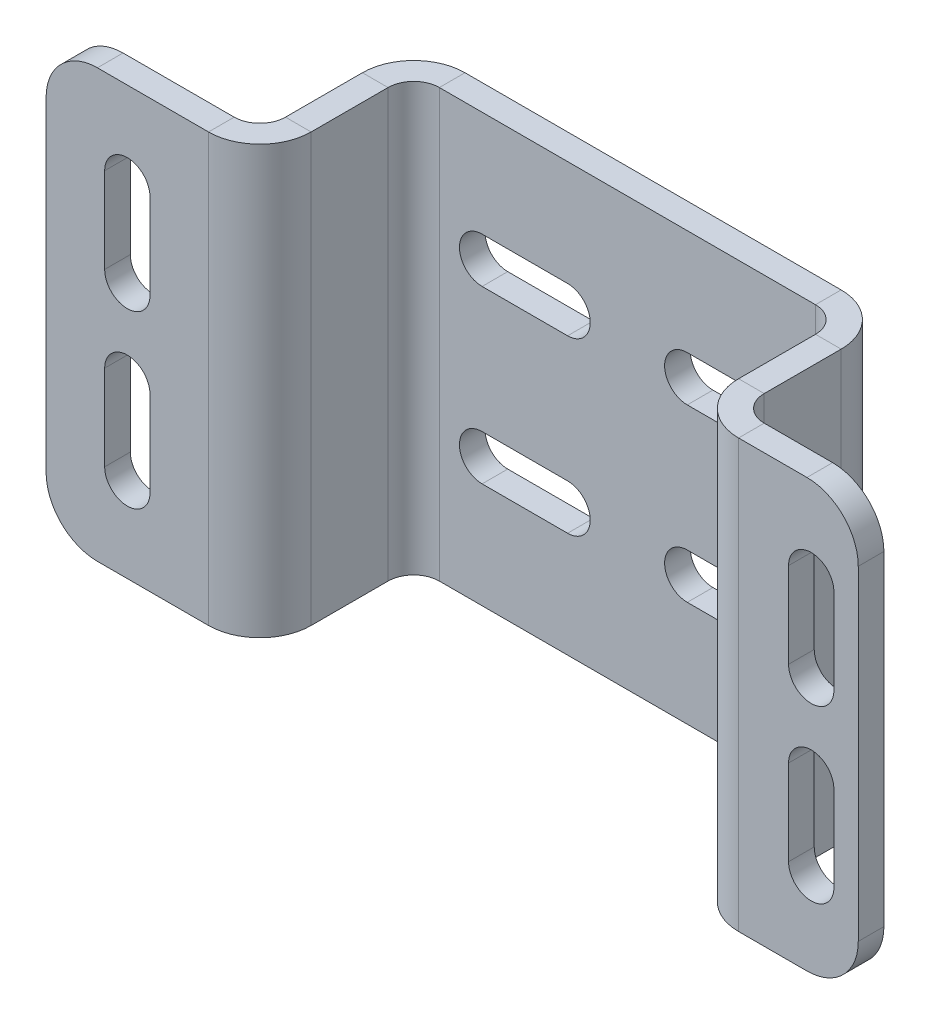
ISO-10303-21;
HEADER;
FILE_DESCRIPTION(('STEP AP214'),'2;1');
FILE_NAME('part.step','',(''),(''),'','','');
FILE_SCHEMA(('AUTOMOTIVE_DESIGN { 1 0 10303 214 1 1 1 1 }'));
ENDSEC;
DATA;
#1=APPLICATION_CONTEXT('core data for automotive mechanical design processes');
#2=APPLICATION_PROTOCOL_DEFINITION('international standard','automotive_design',2000,#1);
#3=PRODUCT_CONTEXT('',#1,'mechanical');
#4=PRODUCT('Part','Part','',(#3));
#5=PRODUCT_RELATED_PRODUCT_CATEGORY('part','',(#4));
#6=PRODUCT_DEFINITION_FORMATION('','',#4);
#7=PRODUCT_DEFINITION_CONTEXT('part definition',#1,'design');
#8=PRODUCT_DEFINITION('design','',#6,#7);
#9=PRODUCT_DEFINITION_SHAPE('','',#8);
#10=(LENGTH_UNIT() NAMED_UNIT(*) SI_UNIT(.MILLI.,.METRE.));
#11=(NAMED_UNIT(*) PLANE_ANGLE_UNIT() SI_UNIT($,.RADIAN.));
#12=(NAMED_UNIT(*) SI_UNIT($,.STERADIAN.) SOLID_ANGLE_UNIT());
#13=UNCERTAINTY_MEASURE_WITH_UNIT(LENGTH_MEASURE(1.E-05),#10,'distance_accuracy_value','');
#14=(GEOMETRIC_REPRESENTATION_CONTEXT(3) GLOBAL_UNCERTAINTY_ASSIGNED_CONTEXT((#13)) GLOBAL_UNIT_ASSIGNED_CONTEXT((#10,
#11,#12)) REPRESENTATION_CONTEXT('',''));
#15=CARTESIAN_POINT('',(0.,0.,0.));
#16=DIRECTION('',(0.,0.,1.));
#17=DIRECTION('',(1.,0.,0.));
#18=AXIS2_PLACEMENT_3D('',#15,#16,#17);
#19=CARTESIAN_POINT('',(0.,50.,2.99999999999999));
#20=DIRECTION('',(0.,-1.,0.));
#21=DIRECTION('',(0.,0.,-1.));
#22=AXIS2_PLACEMENT_3D('',#19,#20,#21);
#23=PLANE('',#22);
#24=DIRECTION('',(1.,0.,0.));
#25=VECTOR('',#24,1.);
#26=CARTESIAN_POINT('',(0.,50.,15.));
#27=LINE('',#26,#25);
#28=CARTESIAN_POINT('',(0.,50.,15.));
#29=VERTEX_POINT('',#28);
#30=CARTESIAN_POINT('',(2.99999999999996,50.,15.));
#31=VERTEX_POINT('',#30);
#32=EDGE_CURVE('E601',#29,#31,#27,.T.);
#33=ORIENTED_EDGE('',*,*,#32,.T.);
#34=DIRECTION('',(0.,0.,1.));
#35=VECTOR('',#34,1.);
#36=CARTESIAN_POINT('',(3.,50.,3.));
#37=LINE('',#36,#35);
#38=CARTESIAN_POINT('',(2.99999999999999,50.,5.99999999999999));
#39=VERTEX_POINT('',#38);
#40=EDGE_CURVE('E800',#31,#39,#37,.F.);
#41=ORIENTED_EDGE('',*,*,#40,.T.);
#42=DIRECTION('',(1.,0.,0.));
#43=VECTOR('',#42,1.);
#44=CARTESIAN_POINT('',(0.,50.,5.99999999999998));
#45=LINE('',#44,#43);
#46=CARTESIAN_POINT('',(0.,50.,5.99999999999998));
#47=VERTEX_POINT('',#46);
#48=EDGE_CURVE('E790',#39,#47,#45,.F.);
#49=ORIENTED_EDGE('',*,*,#48,.T.);
#50=DIRECTION('',(0.,0.,-1.));
#51=VECTOR('',#50,1.);
#52=CARTESIAN_POINT('',(0.,50.,18.));
#53=LINE('',#52,#51);
#54=EDGE_CURVE('E795',#29,#47,#53,.T.);
#55=ORIENTED_EDGE('',*,*,#54,.F.);
#56=EDGE_LOOP('',(#33,#41,#49,#55));
#57=FACE_BOUND('',#56,.T.);
#58=ADVANCED_FACE('F74',(#57),#23,.F.);
#59=CARTESIAN_POINT('',(0.,0.,18.));
#60=DIRECTION('',(0.,1.,0.));
#61=DIRECTION('',(0.,0.,1.));
#62=AXIS2_PLACEMENT_3D('',#59,#60,#61);
#63=PLANE('',#62);
#64=DIRECTION('',(1.,0.,0.));
#65=VECTOR('',#64,1.);
#66=CARTESIAN_POINT('',(0.,0.,15.));
#67=LINE('',#66,#65);
#68=CARTESIAN_POINT('',(0.,0.,15.));
#69=VERTEX_POINT('',#68);
#70=CARTESIAN_POINT('',(2.99999999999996,0.,15.));
#71=VERTEX_POINT('',#70);
#72=EDGE_CURVE('E611',#69,#71,#67,.T.);
#73=ORIENTED_EDGE('',*,*,#72,.F.);
#74=DIRECTION('',(0.,0.,1.));
#75=VECTOR('',#74,1.);
#76=CARTESIAN_POINT('',(0.,0.,18.));
#77=LINE('',#76,#75);
#78=CARTESIAN_POINT('',(0.,0.,5.99999999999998));
#79=VERTEX_POINT('',#78);
#80=EDGE_CURVE('E791',#79,#69,#77,.T.);
#81=ORIENTED_EDGE('',*,*,#80,.F.);
#82=DIRECTION('',(1.,0.,0.));
#83=VECTOR('',#82,1.);
#84=CARTESIAN_POINT('',(2.99999999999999,0.,5.99999999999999));
#85=LINE('',#84,#83);
#86=CARTESIAN_POINT('',(2.99999999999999,0.,5.99999999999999));
#87=VERTEX_POINT('',#86);
#88=EDGE_CURVE('E805',#87,#79,#85,.F.);
#89=ORIENTED_EDGE('',*,*,#88,.F.);
#90=DIRECTION('',(0.,0.,-1.));
#91=VECTOR('',#90,1.);
#92=CARTESIAN_POINT('',(2.99999999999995,0.,18.));
#93=LINE('',#92,#91);
#94=EDGE_CURVE('E797',#87,#71,#93,.F.);
#95=ORIENTED_EDGE('',*,*,#94,.T.);
#96=EDGE_LOOP('',(#73,#81,#89,#95));
#97=FACE_BOUND('',#96,.T.);
#98=ADVANCED_FACE('F954',(#97),#63,.F.);
#99=CARTESIAN_POINT('',(0.,50.,18.));
#100=DIRECTION('',(1.,0.,0.));
#101=DIRECTION('',(0.,0.,-1.));
#102=AXIS2_PLACEMENT_3D('',#99,#100,#101);
#103=PLANE('',#102);
#104=DIRECTION('',(0.,1.,0.));
#105=VECTOR('',#104,1.);
#106=CARTESIAN_POINT('',(0.,50.,15.));
#107=LINE('',#106,#105);
#108=EDGE_CURVE('E607',#29,#69,#107,.F.);
#109=ORIENTED_EDGE('',*,*,#108,.F.);
#110=ORIENTED_EDGE('',*,*,#54,.T.);
#111=DIRECTION('',(0.,-1.,0.));
#112=VECTOR('',#111,1.);
#113=CARTESIAN_POINT('',(0.,50.,5.99999999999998));
#114=LINE('',#113,#112);
#115=EDGE_CURVE('E802',#79,#47,#114,.F.);
#116=ORIENTED_EDGE('',*,*,#115,.F.);
#117=ORIENTED_EDGE('',*,*,#80,.T.);
#118=EDGE_LOOP('',(#109,#110,#116,#117));
#119=FACE_BOUND('',#118,.T.);
#120=ADVANCED_FACE('F959',(#119),#103,.F.);
#121=CARTESIAN_POINT('',(2.99999999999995,50.,18.));
#122=DIRECTION('',(1.,0.,0.));
#123=DIRECTION('',(0.,0.,-1.));
#124=AXIS2_PLACEMENT_3D('',#121,#122,#123);
#125=PLANE('',#124);
#126=ORIENTED_EDGE('',*,*,#40,.F.);
#127=DIRECTION('',(0.,1.,0.));
#128=VECTOR('',#127,1.);
#129=CARTESIAN_POINT('',(2.99999999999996,50.,15.));
#130=LINE('',#129,#128);
#131=EDGE_CURVE('E594',#31,#71,#130,.F.);
#132=ORIENTED_EDGE('',*,*,#131,.T.);
#133=ORIENTED_EDGE('',*,*,#94,.F.);
#134=DIRECTION('',(0.,-1.,0.));
#135=VECTOR('',#134,1.);
#136=CARTESIAN_POINT('',(2.99999999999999,50.,5.99999999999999));
#137=LINE('',#136,#135);
#138=EDGE_CURVE('E808',#39,#87,#137,.T.);
#139=ORIENTED_EDGE('',*,*,#138,.F.);
#140=EDGE_LOOP('',(#126,#132,#133,#139));
#141=FACE_BOUND('',#140,.T.);
#142=ADVANCED_FACE('F972',(#141),#125,.T.);
#143=CARTESIAN_POINT('',(56.0000000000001,50.,18.));
#144=DIRECTION('',(0.,-1.,0.));
#145=DIRECTION('',(0.,0.,-1.));
#146=AXIS2_PLACEMENT_3D('',#143,#144,#145);
#147=PLANE('',#146);
#148=DIRECTION('',(-1.,0.,0.));
#149=VECTOR('',#148,1.);
#150=CARTESIAN_POINT('',(56.,50.,15.));
#151=LINE('',#150,#149);
#152=CARTESIAN_POINT('',(56.,50.,15.));
#153=VERTEX_POINT('',#152);
#154=CARTESIAN_POINT('',(53.,50.,15.));
#155=VERTEX_POINT('',#154);
#156=EDGE_CURVE('E661',#153,#155,#151,.T.);
#157=ORIENTED_EDGE('',*,*,#156,.F.);
#158=DIRECTION('',(0.,0.,1.));
#159=VECTOR('',#158,1.);
#160=CARTESIAN_POINT('',(56.,50.,2.99999999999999));
#161=LINE('',#160,#159);
#162=CARTESIAN_POINT('',(56.,50.,5.99999999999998));
#163=VERTEX_POINT('',#162);
#164=EDGE_CURVE('E838',#163,#153,#161,.T.);
#165=ORIENTED_EDGE('',*,*,#164,.F.);
#166=DIRECTION('',(-1.,0.,0.));
#167=VECTOR('',#166,1.);
#168=CARTESIAN_POINT('',(53.,50.,5.99999999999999));
#169=LINE('',#168,#167);
#170=CARTESIAN_POINT('',(53.,50.,5.99999999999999));
#171=VERTEX_POINT('',#170);
#172=EDGE_CURVE('E849',#171,#163,#169,.F.);
#173=ORIENTED_EDGE('',*,*,#172,.F.);
#174=DIRECTION('',(0.,0.,-1.));
#175=VECTOR('',#174,1.);
#176=CARTESIAN_POINT('',(53.0000000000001,50.,18.));
#177=LINE('',#176,#175);
#178=EDGE_CURVE('E843',#171,#155,#177,.F.);
#179=ORIENTED_EDGE('',*,*,#178,.T.);
#180=EDGE_LOOP('',(#157,#165,#173,#179));
#181=FACE_BOUND('',#180,.T.);
#182=ADVANCED_FACE('F1017',(#181),#147,.F.);
#183=CARTESIAN_POINT('',(56.,0.,2.99999999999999));
#184=DIRECTION('',(0.,1.,0.));
#185=DIRECTION('',(0.,0.,1.));
#186=AXIS2_PLACEMENT_3D('',#183,#184,#185);
#187=PLANE('',#186);
#188=DIRECTION('',(-1.,0.,0.));
#189=VECTOR('',#188,1.);
#190=CARTESIAN_POINT('',(56.,0.,15.));
#191=LINE('',#190,#189);
#192=CARTESIAN_POINT('',(56.,0.,15.));
#193=VERTEX_POINT('',#192);
#194=CARTESIAN_POINT('',(53.,0.,15.));
#195=VERTEX_POINT('',#194);
#196=EDGE_CURVE('E651',#193,#195,#191,.T.);
#197=ORIENTED_EDGE('',*,*,#196,.T.);
#198=DIRECTION('',(0.,0.,1.));
#199=VECTOR('',#198,1.);
#200=CARTESIAN_POINT('',(53.,0.,3.));
#201=LINE('',#200,#199);
#202=CARTESIAN_POINT('',(53.,0.,5.99999999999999));
#203=VERTEX_POINT('',#202);
#204=EDGE_CURVE('E841',#195,#203,#201,.F.);
#205=ORIENTED_EDGE('',*,*,#204,.T.);
#206=DIRECTION('',(-1.,0.,0.));
#207=VECTOR('',#206,1.);
#208=CARTESIAN_POINT('',(56.,0.,5.99999999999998));
#209=LINE('',#208,#207);
#210=CARTESIAN_POINT('',(56.,0.,5.99999999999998));
#211=VERTEX_POINT('',#210);
#212=EDGE_CURVE('E832',#203,#211,#209,.F.);
#213=ORIENTED_EDGE('',*,*,#212,.T.);
#214=DIRECTION('',(0.,0.,-1.));
#215=VECTOR('',#214,1.);
#216=CARTESIAN_POINT('',(56.,0.,2.99999999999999));
#217=LINE('',#216,#215);
#218=EDGE_CURVE('E835',#193,#211,#217,.T.);
#219=ORIENTED_EDGE('',*,*,#218,.F.);
#220=EDGE_LOOP('',(#197,#205,#213,#219));
#221=FACE_BOUND('',#220,.T.);
#222=ADVANCED_FACE('F1009',(#221),#187,.F.);
#223=CARTESIAN_POINT('',(56.,50.,2.99999999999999));
#224=DIRECTION('',(-1.,0.,0.));
#225=DIRECTION('',(0.,0.,1.));
#226=AXIS2_PLACEMENT_3D('',#223,#224,#225);
#227=PLANE('',#226);
#228=DIRECTION('',(0.,-1.,0.));
#229=VECTOR('',#228,1.);
#230=CARTESIAN_POINT('',(56.,0.,15.));
#231=LINE('',#230,#229);
#232=EDGE_CURVE('E657',#193,#153,#231,.F.);
#233=ORIENTED_EDGE('',*,*,#232,.F.);
#234=ORIENTED_EDGE('',*,*,#218,.T.);
#235=DIRECTION('',(0.,1.,0.));
#236=VECTOR('',#235,1.);
#237=CARTESIAN_POINT('',(56.,0.,5.99999999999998));
#238=LINE('',#237,#236);
#239=EDGE_CURVE('E846',#163,#211,#238,.F.);
#240=ORIENTED_EDGE('',*,*,#239,.F.);
#241=ORIENTED_EDGE('',*,*,#164,.T.);
#242=EDGE_LOOP('',(#233,#234,#240,#241));
#243=FACE_BOUND('',#242,.T.);
#244=ADVANCED_FACE('F1020',(#243),#227,.F.);
#245=CARTESIAN_POINT('',(53.,50.,3.));
#246=DIRECTION('',(-1.,0.,0.));
#247=DIRECTION('',(0.,0.,1.));
#248=AXIS2_PLACEMENT_3D('',#245,#246,#247);
#249=PLANE('',#248);
#250=ORIENTED_EDGE('',*,*,#204,.F.);
#251=DIRECTION('',(0.,-1.,0.));
#252=VECTOR('',#251,1.);
#253=CARTESIAN_POINT('',(53.,0.,15.));
#254=LINE('',#253,#252);
#255=EDGE_CURVE('E644',#195,#155,#254,.F.);
#256=ORIENTED_EDGE('',*,*,#255,.T.);
#257=ORIENTED_EDGE('',*,*,#178,.F.);
#258=DIRECTION('',(0.,1.,0.));
#259=VECTOR('',#258,1.);
#260=CARTESIAN_POINT('',(53.,0.,5.99999999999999));
#261=LINE('',#260,#259);
#262=EDGE_CURVE('E852',#203,#171,#261,.T.);
#263=ORIENTED_EDGE('',*,*,#262,.F.);
#264=EDGE_LOOP('',(#250,#256,#257,#263));
#265=FACE_BOUND('',#264,.T.);
#266=ADVANCED_FACE('F1012',(#265),#249,.T.);
#267=CARTESIAN_POINT('',(0.,0.,3.));
#268=DIRECTION('',(0.,1.,0.));
#269=DIRECTION('',(0.,0.,1.));
#270=AXIS2_PLACEMENT_3D('',#267,#268,#269);
#271=PLANE('',#270);
#272=DIRECTION('',(0.,0.,-1.));
#273=VECTOR('',#272,1.);
#274=CARTESIAN_POINT('',(5.99999999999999,0.,3.));
#275=LINE('',#274,#273);
#276=CARTESIAN_POINT('',(5.99999999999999,0.,3.));
#277=VERTEX_POINT('',#276);
#278=CARTESIAN_POINT('',(5.99999999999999,0.,0.));
#279=VERTEX_POINT('',#278);
#280=EDGE_CURVE('E819',#277,#279,#275,.T.);
#281=ORIENTED_EDGE('',*,*,#280,.T.);
#282=DIRECTION('',(1.,0.,0.));
#283=VECTOR('',#282,1.);
#284=CARTESIAN_POINT('',(0.,0.,0.));
#285=LINE('',#284,#283);
#286=CARTESIAN_POINT('',(50.,0.,0.));
#287=VERTEX_POINT('',#286);
#288=EDGE_CURVE('E876',#279,#287,#285,.T.);
#289=ORIENTED_EDGE('',*,*,#288,.T.);
#290=DIRECTION('',(0.,0.,-1.));
#291=VECTOR('',#290,1.);
#292=CARTESIAN_POINT('',(50.,0.,3.));
#293=LINE('',#292,#291);
#294=CARTESIAN_POINT('',(50.,0.,3.));
#295=VERTEX_POINT('',#294);
#296=EDGE_CURVE('E873',#295,#287,#293,.T.);
#297=ORIENTED_EDGE('',*,*,#296,.F.);
#298=DIRECTION('',(1.,0.,0.));
#299=VECTOR('',#298,1.);
#300=CARTESIAN_POINT('',(0.,0.,3.));
#301=LINE('',#300,#299);
#302=EDGE_CURVE('E879',#277,#295,#301,.T.);
#303=ORIENTED_EDGE('',*,*,#302,.F.);
#304=EDGE_LOOP('',(#281,#289,#297,#303));
#305=FACE_BOUND('',#304,.T.);
#306=ADVANCED_FACE('F982',(#305),#271,.F.);
#307=CARTESIAN_POINT('',(0.,50.,3.));
#308=DIRECTION('',(0.,-1.,0.));
#309=DIRECTION('',(0.,0.,-1.));
#310=AXIS2_PLACEMENT_3D('',#307,#308,#309);
#311=PLANE('',#310);
#312=DIRECTION('',(0.,0.,-1.));
#313=VECTOR('',#312,1.);
#314=CARTESIAN_POINT('',(5.99999999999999,50.,3.));
#315=LINE('',#314,#313);
#316=CARTESIAN_POINT('',(5.99999999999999,50.,3.));
#317=VERTEX_POINT('',#316);
#318=CARTESIAN_POINT('',(5.99999999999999,50.,0.));
#319=VERTEX_POINT('',#318);
#320=EDGE_CURVE('E829',#317,#319,#315,.T.);
#321=ORIENTED_EDGE('',*,*,#320,.F.);
#322=DIRECTION('',(-1.,0.,0.));
#323=VECTOR('',#322,1.);
#324=CARTESIAN_POINT('',(0.,50.,3.));
#325=LINE('',#324,#323);
#326=CARTESIAN_POINT('',(50.,50.,3.));
#327=VERTEX_POINT('',#326);
#328=EDGE_CURVE('E882',#327,#317,#325,.T.);
#329=ORIENTED_EDGE('',*,*,#328,.F.);
#330=DIRECTION('',(0.,0.,-1.));
#331=VECTOR('',#330,1.);
#332=CARTESIAN_POINT('',(50.,50.,3.));
#333=LINE('',#332,#331);
#334=CARTESIAN_POINT('',(50.,50.,0.));
#335=VERTEX_POINT('',#334);
#336=EDGE_CURVE('E863',#327,#335,#333,.T.);
#337=ORIENTED_EDGE('',*,*,#336,.T.);
#338=DIRECTION('',(-1.,0.,0.));
#339=VECTOR('',#338,1.);
#340=CARTESIAN_POINT('',(0.,50.,0.));
#341=LINE('',#340,#339);
#342=EDGE_CURVE('E883',#335,#319,#341,.T.);
#343=ORIENTED_EDGE('',*,*,#342,.T.);
#344=EDGE_LOOP('',(#321,#329,#337,#343));
#345=FACE_BOUND('',#344,.T.);
#346=ADVANCED_FACE('F996',(#345),#311,.F.);
#347=CARTESIAN_POINT('',(0.,50.,3.));
#348=DIRECTION('',(0.,0.,-1.));
#349=DIRECTION('',(-1.,0.,0.));
#350=AXIS2_PLACEMENT_3D('',#347,#348,#349);
#351=PLANE('',#350);
#352=DIRECTION('',(1.,0.,0.));
#353=VECTOR('',#352,1.);
#354=CARTESIAN_POINT('',(35.,32.35,3.));
#355=LINE('',#354,#353);
#356=CARTESIAN_POINT('',(35.,32.35,3.));
#357=VERTEX_POINT('',#356);
#358=CARTESIAN_POINT('',(45.,32.35,3.));
#359=VERTEX_POINT('',#358);
#360=EDGE_CURVE('E668',#357,#359,#355,.T.);
#361=ORIENTED_EDGE('',*,*,#360,.F.);
#362=CARTESIAN_POINT('',(35.,35.,3.));
#363=DIRECTION('',(0.,0.,-1.));
#364=DIRECTION('',(-1.,0.,0.));
#365=AXIS2_PLACEMENT_3D('',#362,#363,#364);
#366=CIRCLE('',#365,2.65000000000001);
#367=CARTESIAN_POINT('',(35.,37.65,3.));
#368=VERTEX_POINT('',#367);
#369=EDGE_CURVE('E671',#368,#357,#366,.F.);
#370=ORIENTED_EDGE('',*,*,#369,.F.);
#371=DIRECTION('',(-1.,0.,0.));
#372=VECTOR('',#371,1.);
#373=CARTESIAN_POINT('',(35.,37.65,3.));
#374=LINE('',#373,#372);
#375=CARTESIAN_POINT('',(45.,37.65,3.));
#376=VERTEX_POINT('',#375);
#377=EDGE_CURVE('E688',#376,#368,#374,.T.);
#378=ORIENTED_EDGE('',*,*,#377,.F.);
#379=CARTESIAN_POINT('',(45.,35.,3.));
#380=DIRECTION('',(0.,0.,-1.));
#381=DIRECTION('',(-1.,0.,0.));
#382=AXIS2_PLACEMENT_3D('',#379,#380,#381);
#383=CIRCLE('',#382,2.65);
#384=EDGE_CURVE('E664',#359,#376,#383,.F.);
#385=ORIENTED_EDGE('',*,*,#384,.F.);
#386=EDGE_LOOP('',(#361,#370,#378,#385));
#387=FACE_BOUND('',#386,.T.);
#388=DIRECTION('',(1.,0.,0.));
#389=VECTOR('',#388,1.);
#390=CARTESIAN_POINT('',(35.,12.35,3.));
#391=LINE('',#390,#389);
#392=CARTESIAN_POINT('',(35.,12.35,3.));
#393=VERTEX_POINT('',#392);
#394=CARTESIAN_POINT('',(45.,12.35,3.));
#395=VERTEX_POINT('',#394);
#396=EDGE_CURVE('E699',#393,#395,#391,.T.);
#397=ORIENTED_EDGE('',*,*,#396,.F.);
#398=CARTESIAN_POINT('',(35.,15.,3.));
#399=DIRECTION('',(0.,0.,-1.));
#400=DIRECTION('',(-1.,0.,0.));
#401=AXIS2_PLACEMENT_3D('',#398,#399,#400);
#402=CIRCLE('',#401,2.65);
#403=CARTESIAN_POINT('',(35.,17.65,3.));
#404=VERTEX_POINT('',#403);
#405=EDGE_CURVE('E702',#404,#393,#402,.F.);
#406=ORIENTED_EDGE('',*,*,#405,.F.);
#407=DIRECTION('',(-1.,0.,0.));
#408=VECTOR('',#407,1.);
#409=CARTESIAN_POINT('',(35.,17.65,3.));
#410=LINE('',#409,#408);
#411=CARTESIAN_POINT('',(45.,17.65,3.));
#412=VERTEX_POINT('',#411);
#413=EDGE_CURVE('E719',#412,#404,#410,.T.);
#414=ORIENTED_EDGE('',*,*,#413,.F.);
#415=CARTESIAN_POINT('',(45.,15.,3.));
#416=DIRECTION('',(0.,0.,-1.));
#417=DIRECTION('',(-1.,0.,0.));
#418=AXIS2_PLACEMENT_3D('',#415,#416,#417);
#419=CIRCLE('',#418,2.65);
#420=EDGE_CURVE('E697',#395,#412,#419,.F.);
#421=ORIENTED_EDGE('',*,*,#420,.F.);
#422=EDGE_LOOP('',(#397,#406,#414,#421));
#423=FACE_BOUND('',#422,.T.);
#424=DIRECTION('',(1.,0.,0.));
#425=VECTOR('',#424,1.);
#426=CARTESIAN_POINT('',(11.,32.35,3.));
#427=LINE('',#426,#425);
#428=CARTESIAN_POINT('',(11.,32.35,3.));
#429=VERTEX_POINT('',#428);
#430=CARTESIAN_POINT('',(21.,32.35,3.));
#431=VERTEX_POINT('',#430);
#432=EDGE_CURVE('E730',#429,#431,#427,.T.);
#433=ORIENTED_EDGE('',*,*,#432,.F.);
#434=CARTESIAN_POINT('',(11.,35.,3.));
#435=DIRECTION('',(0.,0.,-1.));
#436=DIRECTION('',(-1.,0.,0.));
#437=AXIS2_PLACEMENT_3D('',#434,#435,#436);
#438=CIRCLE('',#437,2.65);
#439=CARTESIAN_POINT('',(11.,37.65,3.));
#440=VERTEX_POINT('',#439);
#441=EDGE_CURVE('E733',#440,#429,#438,.F.);
#442=ORIENTED_EDGE('',*,*,#441,.F.);
#443=DIRECTION('',(-1.,0.,0.));
#444=VECTOR('',#443,1.);
#445=CARTESIAN_POINT('',(11.,37.65,3.));
#446=LINE('',#445,#444);
#447=CARTESIAN_POINT('',(21.,37.65,3.));
#448=VERTEX_POINT('',#447);
#449=EDGE_CURVE('E750',#448,#440,#446,.T.);
#450=ORIENTED_EDGE('',*,*,#449,.F.);
#451=CARTESIAN_POINT('',(21.,35.,3.));
#452=DIRECTION('',(0.,0.,-1.));
#453=DIRECTION('',(-1.,0.,0.));
#454=AXIS2_PLACEMENT_3D('',#451,#452,#453);
#455=CIRCLE('',#454,2.65);
#456=EDGE_CURVE('E728',#431,#448,#455,.F.);
#457=ORIENTED_EDGE('',*,*,#456,.F.);
#458=EDGE_LOOP('',(#433,#442,#450,#457));
#459=FACE_BOUND('',#458,.T.);
#460=DIRECTION('',(1.,0.,0.));
#461=VECTOR('',#460,1.);
#462=CARTESIAN_POINT('',(11.,12.35,3.));
#463=LINE('',#462,#461);
#464=CARTESIAN_POINT('',(11.,12.35,3.));
#465=VERTEX_POINT('',#464);
#466=CARTESIAN_POINT('',(21.,12.35,3.));
#467=VERTEX_POINT('',#466);
#468=EDGE_CURVE('E761',#465,#467,#463,.T.);
#469=ORIENTED_EDGE('',*,*,#468,.F.);
#470=CARTESIAN_POINT('',(11.,15.,3.));
#471=DIRECTION('',(0.,0.,-1.));
#472=DIRECTION('',(-1.,0.,0.));
#473=AXIS2_PLACEMENT_3D('',#470,#471,#472);
#474=CIRCLE('',#473,2.65);
#475=CARTESIAN_POINT('',(11.,17.65,3.));
#476=VERTEX_POINT('',#475);
#477=EDGE_CURVE('E764',#476,#465,#474,.F.);
#478=ORIENTED_EDGE('',*,*,#477,.F.);
#479=DIRECTION('',(-1.,0.,0.));
#480=VECTOR('',#479,1.);
#481=CARTESIAN_POINT('',(11.,17.65,3.));
#482=LINE('',#481,#480);
#483=CARTESIAN_POINT('',(21.,17.65,3.));
#484=VERTEX_POINT('',#483);
#485=EDGE_CURVE('E781',#484,#476,#482,.T.);
#486=ORIENTED_EDGE('',*,*,#485,.F.);
#487=CARTESIAN_POINT('',(21.,15.,3.));
#488=DIRECTION('',(0.,0.,-1.));
#489=DIRECTION('',(-1.,0.,0.));
#490=AXIS2_PLACEMENT_3D('',#487,#488,#489);
#491=CIRCLE('',#490,2.65);
#492=EDGE_CURVE('E759',#467,#484,#491,.F.);
#493=ORIENTED_EDGE('',*,*,#492,.F.);
#494=EDGE_LOOP('',(#469,#478,#486,#493));
#495=FACE_BOUND('',#494,.T.);
#496=DIRECTION('',(0.,-1.,0.));
#497=VECTOR('',#496,1.);
#498=CARTESIAN_POINT('',(5.99999999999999,0.,3.));
#499=LINE('',#498,#497);
#500=EDGE_CURVE('E825',#277,#317,#499,.F.);
#501=ORIENTED_EDGE('',*,*,#500,.F.);
#502=ORIENTED_EDGE('',*,*,#302,.T.);
#503=DIRECTION('',(0.,1.,0.));
#504=VECTOR('',#503,1.);
#505=CARTESIAN_POINT('',(50.,50.,3.));
#506=LINE('',#505,#504);
#507=EDGE_CURVE('E869',#327,#295,#506,.F.);
#508=ORIENTED_EDGE('',*,*,#507,.F.);
#509=ORIENTED_EDGE('',*,*,#328,.T.);
#510=EDGE_LOOP('',(#501,#502,#508,#509));
#511=FACE_BOUND('',#510,.T.);
#512=ADVANCED_FACE('F999',(#387,#423,#459,#495,#511),#351,.F.);
#513=CARTESIAN_POINT('',(0.,50.,0.));
#514=DIRECTION('',(0.,0.,-1.));
#515=DIRECTION('',(-1.,0.,0.));
#516=AXIS2_PLACEMENT_3D('',#513,#514,#515);
#517=PLANE('',#516);
#518=CARTESIAN_POINT('',(35.,35.,0.));
#519=DIRECTION('',(0.,0.,-1.));
#520=DIRECTION('',(-1.,0.,0.));
#521=AXIS2_PLACEMENT_3D('',#518,#519,#520);
#522=CIRCLE('',#521,2.65000000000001);
#523=CARTESIAN_POINT('',(35.,32.35,0.));
#524=VERTEX_POINT('',#523);
#525=CARTESIAN_POINT('',(35.,37.65,0.));
#526=VERTEX_POINT('',#525);
#527=EDGE_CURVE('E674',#524,#526,#522,.T.);
#528=ORIENTED_EDGE('',*,*,#527,.F.);
#529=DIRECTION('',(-1.,0.,0.));
#530=VECTOR('',#529,1.);
#531=CARTESIAN_POINT('',(35.,32.35,0.));
#532=LINE('',#531,#530);
#533=CARTESIAN_POINT('',(45.,32.35,0.));
#534=VERTEX_POINT('',#533);
#535=EDGE_CURVE('E682',#534,#524,#532,.T.);
#536=ORIENTED_EDGE('',*,*,#535,.F.);
#537=CARTESIAN_POINT('',(45.,35.,0.));
#538=DIRECTION('',(0.,0.,-1.));
#539=DIRECTION('',(-1.,0.,0.));
#540=AXIS2_PLACEMENT_3D('',#537,#538,#539);
#541=CIRCLE('',#540,2.65);
#542=CARTESIAN_POINT('',(45.,37.65,0.));
#543=VERTEX_POINT('',#542);
#544=EDGE_CURVE('E679',#543,#534,#541,.T.);
#545=ORIENTED_EDGE('',*,*,#544,.F.);
#546=DIRECTION('',(1.,0.,0.));
#547=VECTOR('',#546,1.);
#548=CARTESIAN_POINT('',(35.,37.65,0.));
#549=LINE('',#548,#547);
#550=EDGE_CURVE('E676',#526,#543,#549,.T.);
#551=ORIENTED_EDGE('',*,*,#550,.F.);
#552=EDGE_LOOP('',(#528,#536,#545,#551));
#553=FACE_BOUND('',#552,.T.);
#554=CARTESIAN_POINT('',(35.,15.,0.));
#555=DIRECTION('',(0.,0.,-1.));
#556=DIRECTION('',(-1.,0.,0.));
#557=AXIS2_PLACEMENT_3D('',#554,#555,#556);
#558=CIRCLE('',#557,2.65);
#559=CARTESIAN_POINT('',(35.,12.35,0.));
#560=VERTEX_POINT('',#559);
#561=CARTESIAN_POINT('',(35.,17.65,0.));
#562=VERTEX_POINT('',#561);
#563=EDGE_CURVE('E705',#560,#562,#558,.T.);
#564=ORIENTED_EDGE('',*,*,#563,.F.);
#565=DIRECTION('',(-1.,0.,0.));
#566=VECTOR('',#565,1.);
#567=CARTESIAN_POINT('',(35.,12.35,0.));
#568=LINE('',#567,#566);
#569=CARTESIAN_POINT('',(45.,12.35,0.));
#570=VERTEX_POINT('',#569);
#571=EDGE_CURVE('E713',#570,#560,#568,.T.);
#572=ORIENTED_EDGE('',*,*,#571,.F.);
#573=CARTESIAN_POINT('',(45.,15.,0.));
#574=DIRECTION('',(0.,0.,-1.));
#575=DIRECTION('',(-1.,0.,0.));
#576=AXIS2_PLACEMENT_3D('',#573,#574,#575);
#577=CIRCLE('',#576,2.65);
#578=CARTESIAN_POINT('',(45.,17.65,0.));
#579=VERTEX_POINT('',#578);
#580=EDGE_CURVE('E710',#579,#570,#577,.T.);
#581=ORIENTED_EDGE('',*,*,#580,.F.);
#582=DIRECTION('',(1.,0.,0.));
#583=VECTOR('',#582,1.);
#584=CARTESIAN_POINT('',(35.,17.65,0.));
#585=LINE('',#584,#583);
#586=EDGE_CURVE('E707',#562,#579,#585,.T.);
#587=ORIENTED_EDGE('',*,*,#586,.F.);
#588=EDGE_LOOP('',(#564,#572,#581,#587));
#589=FACE_BOUND('',#588,.T.);
#590=CARTESIAN_POINT('',(11.,35.,0.));
#591=DIRECTION('',(0.,0.,-1.));
#592=DIRECTION('',(-1.,0.,0.));
#593=AXIS2_PLACEMENT_3D('',#590,#591,#592);
#594=CIRCLE('',#593,2.65);
#595=CARTESIAN_POINT('',(11.,32.35,0.));
#596=VERTEX_POINT('',#595);
#597=CARTESIAN_POINT('',(11.,37.65,0.));
#598=VERTEX_POINT('',#597);
#599=EDGE_CURVE('E736',#596,#598,#594,.T.);
#600=ORIENTED_EDGE('',*,*,#599,.F.);
#601=DIRECTION('',(-1.,0.,0.));
#602=VECTOR('',#601,1.);
#603=CARTESIAN_POINT('',(11.,32.35,0.));
#604=LINE('',#603,#602);
#605=CARTESIAN_POINT('',(21.,32.35,0.));
#606=VERTEX_POINT('',#605);
#607=EDGE_CURVE('E744',#606,#596,#604,.T.);
#608=ORIENTED_EDGE('',*,*,#607,.F.);
#609=CARTESIAN_POINT('',(21.,35.,0.));
#610=DIRECTION('',(0.,0.,-1.));
#611=DIRECTION('',(-1.,0.,0.));
#612=AXIS2_PLACEMENT_3D('',#609,#610,#611);
#613=CIRCLE('',#612,2.65);
#614=CARTESIAN_POINT('',(21.,37.65,0.));
#615=VERTEX_POINT('',#614);
#616=EDGE_CURVE('E741',#615,#606,#613,.T.);
#617=ORIENTED_EDGE('',*,*,#616,.F.);
#618=DIRECTION('',(1.,0.,0.));
#619=VECTOR('',#618,1.);
#620=CARTESIAN_POINT('',(11.,37.65,0.));
#621=LINE('',#620,#619);
#622=EDGE_CURVE('E738',#598,#615,#621,.T.);
#623=ORIENTED_EDGE('',*,*,#622,.F.);
#624=EDGE_LOOP('',(#600,#608,#617,#623));
#625=FACE_BOUND('',#624,.T.);
#626=CARTESIAN_POINT('',(11.,15.,0.));
#627=DIRECTION('',(0.,0.,-1.));
#628=DIRECTION('',(-1.,0.,0.));
#629=AXIS2_PLACEMENT_3D('',#626,#627,#628);
#630=CIRCLE('',#629,2.65);
#631=CARTESIAN_POINT('',(11.,12.35,0.));
#632=VERTEX_POINT('',#631);
#633=CARTESIAN_POINT('',(11.,17.65,0.));
#634=VERTEX_POINT('',#633);
#635=EDGE_CURVE('E767',#632,#634,#630,.T.);
#636=ORIENTED_EDGE('',*,*,#635,.F.);
#637=DIRECTION('',(-1.,0.,0.));
#638=VECTOR('',#637,1.);
#639=CARTESIAN_POINT('',(11.,12.35,0.));
#640=LINE('',#639,#638);
#641=CARTESIAN_POINT('',(21.,12.35,0.));
#642=VERTEX_POINT('',#641);
#643=EDGE_CURVE('E775',#642,#632,#640,.T.);
#644=ORIENTED_EDGE('',*,*,#643,.F.);
#645=CARTESIAN_POINT('',(21.,15.,0.));
#646=DIRECTION('',(0.,0.,-1.));
#647=DIRECTION('',(-1.,0.,0.));
#648=AXIS2_PLACEMENT_3D('',#645,#646,#647);
#649=CIRCLE('',#648,2.65);
#650=CARTESIAN_POINT('',(21.,17.65,0.));
#651=VERTEX_POINT('',#650);
#652=EDGE_CURVE('E772',#651,#642,#649,.T.);
#653=ORIENTED_EDGE('',*,*,#652,.F.);
#654=DIRECTION('',(1.,0.,0.));
#655=VECTOR('',#654,1.);
#656=CARTESIAN_POINT('',(11.,17.65,0.));
#657=LINE('',#656,#655);
#658=EDGE_CURVE('E769',#634,#651,#657,.T.);
#659=ORIENTED_EDGE('',*,*,#658,.F.);
#660=EDGE_LOOP('',(#636,#644,#653,#659));
#661=FACE_BOUND('',#660,.T.);
#662=ORIENTED_EDGE('',*,*,#288,.F.);
#663=DIRECTION('',(0.,-1.,0.));
#664=VECTOR('',#663,1.);
#665=CARTESIAN_POINT('',(5.99999999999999,0.,0.));
#666=LINE('',#665,#664);
#667=EDGE_CURVE('E812',#279,#319,#666,.F.);
#668=ORIENTED_EDGE('',*,*,#667,.T.);
#669=ORIENTED_EDGE('',*,*,#342,.F.);
#670=DIRECTION('',(0.,1.,0.));
#671=VECTOR('',#670,1.);
#672=CARTESIAN_POINT('',(50.,50.,0.));
#673=LINE('',#672,#671);
#674=EDGE_CURVE('E856',#335,#287,#673,.F.);
#675=ORIENTED_EDGE('',*,*,#674,.T.);
#676=EDGE_LOOP('',(#662,#668,#669,#675));
#677=FACE_BOUND('',#676,.T.);
#678=ADVANCED_FACE('F985',(#553,#589,#625,#661,#677),#517,.T.);
#679=CARTESIAN_POINT('',(50.,0.,6.));
#680=DIRECTION('',(0.,-1.,0.));
#681=DIRECTION('',(0.,0.,-1.));
#682=AXIS2_PLACEMENT_3D('',#679,#680,#681);
#683=PLANE('',#682);
#684=ORIENTED_EDGE('',*,*,#212,.F.);
#685=CARTESIAN_POINT('',(50.,0.,6.));
#686=DIRECTION('',(0.,1.,0.));
#687=DIRECTION('',(0.,0.,1.));
#688=AXIS2_PLACEMENT_3D('',#685,#686,#687);
#689=CIRCLE('',#688,3.);
#690=EDGE_CURVE('E866',#295,#203,#689,.F.);
#691=ORIENTED_EDGE('',*,*,#690,.F.);
#692=ORIENTED_EDGE('',*,*,#296,.T.);
#693=CARTESIAN_POINT('',(50.,0.,6.));
#694=DIRECTION('',(0.,1.,0.));
#695=DIRECTION('',(0.,0.,1.));
#696=AXIS2_PLACEMENT_3D('',#693,#694,#695);
#697=CIRCLE('',#696,6.);
#698=EDGE_CURVE('E859',#287,#211,#697,.F.);
#699=ORIENTED_EDGE('',*,*,#698,.T.);
#700=EDGE_LOOP('',(#684,#691,#692,#699));
#701=FACE_BOUND('',#700,.T.);
#702=ADVANCED_FACE('F1006',(#701),#683,.T.);
#703=CARTESIAN_POINT('',(50.,50.,6.));
#704=DIRECTION('',(0.,-1.,0.));
#705=DIRECTION('',(0.,0.,-1.));
#706=AXIS2_PLACEMENT_3D('',#703,#704,#705);
#707=PLANE('',#706);
#708=CARTESIAN_POINT('',(50.,50.,6.));
#709=DIRECTION('',(0.,1.,0.));
#710=DIRECTION('',(0.,0.,1.));
#711=AXIS2_PLACEMENT_3D('',#708,#709,#710);
#712=CIRCLE('',#711,3.);
#713=EDGE_CURVE('E837',#171,#327,#712,.T.);
#714=ORIENTED_EDGE('',*,*,#713,.F.);
#715=ORIENTED_EDGE('',*,*,#172,.T.);
#716=CARTESIAN_POINT('',(50.,50.,6.));
#717=DIRECTION('',(0.,1.,0.));
#718=DIRECTION('',(0.,0.,1.));
#719=AXIS2_PLACEMENT_3D('',#716,#717,#718);
#720=CIRCLE('',#719,6.);
#721=EDGE_CURVE('E860',#163,#335,#720,.T.);
#722=ORIENTED_EDGE('',*,*,#721,.T.);
#723=ORIENTED_EDGE('',*,*,#336,.F.);
#724=EDGE_LOOP('',(#714,#715,#722,#723));
#725=FACE_BOUND('',#724,.T.);
#726=ADVANCED_FACE('F991',(#725),#707,.F.);
#727=CARTESIAN_POINT('',(50.,50.,6.));
#728=DIRECTION('',(0.,1.,0.));
#729=DIRECTION('',(1.,0.,0.));
#730=AXIS2_PLACEMENT_3D('',#727,#728,#729);
#731=CYLINDRICAL_SURFACE('',#730,6.);
#732=ORIENTED_EDGE('',*,*,#674,.F.);
#733=ORIENTED_EDGE('',*,*,#721,.F.);
#734=ORIENTED_EDGE('',*,*,#239,.T.);
#735=ORIENTED_EDGE('',*,*,#698,.F.);
#736=EDGE_LOOP('',(#732,#733,#734,#735));
#737=FACE_BOUND('',#736,.T.);
#738=ADVANCED_FACE('F988',(#737),#731,.T.);
#739=CARTESIAN_POINT('',(50.,50.,6.));
#740=DIRECTION('',(0.,1.,0.));
#741=DIRECTION('',(1.,0.,0.));
#742=AXIS2_PLACEMENT_3D('',#739,#740,#741);
#743=CYLINDRICAL_SURFACE('',#742,3.);
#744=ORIENTED_EDGE('',*,*,#507,.T.);
#745=ORIENTED_EDGE('',*,*,#690,.T.);
#746=ORIENTED_EDGE('',*,*,#262,.T.);
#747=ORIENTED_EDGE('',*,*,#713,.T.);
#748=EDGE_LOOP('',(#744,#745,#746,#747));
#749=FACE_BOUND('',#748,.T.);
#750=ADVANCED_FACE('F1002',(#749),#743,.F.);
#751=CARTESIAN_POINT('',(5.99999999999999,50.,6.));
#752=DIRECTION('',(0.,1.,0.));
#753=DIRECTION('',(0.,0.,1.));
#754=AXIS2_PLACEMENT_3D('',#751,#752,#753);
#755=PLANE('',#754);
#756=ORIENTED_EDGE('',*,*,#48,.F.);
#757=CARTESIAN_POINT('',(5.99999999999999,50.,6.));
#758=DIRECTION('',(0.,-1.,0.));
#759=DIRECTION('',(0.,0.,-1.));
#760=AXIS2_PLACEMENT_3D('',#757,#758,#759);
#761=CIRCLE('',#760,3.);
#762=EDGE_CURVE('E822',#317,#39,#761,.F.);
#763=ORIENTED_EDGE('',*,*,#762,.F.);
#764=ORIENTED_EDGE('',*,*,#320,.T.);
#765=CARTESIAN_POINT('',(5.99999999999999,50.,6.));
#766=DIRECTION('',(0.,-1.,0.));
#767=DIRECTION('',(0.,0.,-1.));
#768=AXIS2_PLACEMENT_3D('',#765,#766,#767);
#769=CIRCLE('',#768,6.);
#770=EDGE_CURVE('E815',#319,#47,#769,.F.);
#771=ORIENTED_EDGE('',*,*,#770,.T.);
#772=EDGE_LOOP('',(#756,#763,#764,#771));
#773=FACE_BOUND('',#772,.T.);
#774=ADVANCED_FACE('F965',(#773),#755,.T.);
#775=CARTESIAN_POINT('',(5.99999999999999,0.,6.));
#776=DIRECTION('',(0.,1.,0.));
#777=DIRECTION('',(0.,0.,1.));
#778=AXIS2_PLACEMENT_3D('',#775,#776,#777);
#779=PLANE('',#778);
#780=CARTESIAN_POINT('',(5.99999999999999,0.,6.));
#781=DIRECTION('',(0.,-1.,0.));
#782=DIRECTION('',(0.,0.,-1.));
#783=AXIS2_PLACEMENT_3D('',#780,#781,#782);
#784=CIRCLE('',#783,3.);
#785=EDGE_CURVE('E794',#87,#277,#784,.T.);
#786=ORIENTED_EDGE('',*,*,#785,.F.);
#787=ORIENTED_EDGE('',*,*,#88,.T.);
#788=CARTESIAN_POINT('',(5.99999999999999,0.,6.));
#789=DIRECTION('',(0.,-1.,0.));
#790=DIRECTION('',(0.,0.,-1.));
#791=AXIS2_PLACEMENT_3D('',#788,#789,#790);
#792=CIRCLE('',#791,6.);
#793=EDGE_CURVE('E816',#79,#279,#792,.T.);
#794=ORIENTED_EDGE('',*,*,#793,.T.);
#795=ORIENTED_EDGE('',*,*,#280,.F.);
#796=EDGE_LOOP('',(#786,#787,#794,#795));
#797=FACE_BOUND('',#796,.T.);
#798=ADVANCED_FACE('F978',(#797),#779,.F.);
#799=CARTESIAN_POINT('',(5.99999999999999,0.,6.));
#800=DIRECTION('',(0.,-1.,0.));
#801=DIRECTION('',(-1.,0.,0.));
#802=AXIS2_PLACEMENT_3D('',#799,#800,#801);
#803=CYLINDRICAL_SURFACE('',#802,6.);
#804=ORIENTED_EDGE('',*,*,#667,.F.);
#805=ORIENTED_EDGE('',*,*,#793,.F.);
#806=ORIENTED_EDGE('',*,*,#115,.T.);
#807=ORIENTED_EDGE('',*,*,#770,.F.);
#808=EDGE_LOOP('',(#804,#805,#806,#807));
#809=FACE_BOUND('',#808,.T.);
#810=ADVANCED_FACE('F962',(#809),#803,.T.);
#811=CARTESIAN_POINT('',(5.99999999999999,0.,6.));
#812=DIRECTION('',(0.,-1.,0.));
#813=DIRECTION('',(-1.,0.,0.));
#814=AXIS2_PLACEMENT_3D('',#811,#812,#813);
#815=CYLINDRICAL_SURFACE('',#814,3.);
#816=ORIENTED_EDGE('',*,*,#500,.T.);
#817=ORIENTED_EDGE('',*,*,#762,.T.);
#818=ORIENTED_EDGE('',*,*,#138,.T.);
#819=ORIENTED_EDGE('',*,*,#785,.T.);
#820=EDGE_LOOP('',(#816,#817,#818,#819));
#821=FACE_BOUND('',#820,.T.);
#822=ADVANCED_FACE('F975',(#821),#815,.F.);
#823=CARTESIAN_POINT('',(11.,15.,18.001));
#824=DIRECTION('',(0.,0.,-1.));
#825=DIRECTION('',(-1.,0.,0.));
#826=AXIS2_PLACEMENT_3D('',#823,#824,#825);
#827=CYLINDRICAL_SURFACE('',#826,2.65);
#828=ORIENTED_EDGE('',*,*,#477,.T.);
#829=DIRECTION('',(0.,0.,-1.));
#830=VECTOR('',#829,1.);
#831=CARTESIAN_POINT('',(11.,12.35,18.001));
#832=LINE('',#831,#830);
#833=EDGE_CURVE('E779',#465,#632,#832,.T.);
#834=ORIENTED_EDGE('',*,*,#833,.T.);
#835=ORIENTED_EDGE('',*,*,#635,.T.);
#836=DIRECTION('',(0.,0.,-1.));
#837=VECTOR('',#836,1.);
#838=CARTESIAN_POINT('',(11.,17.65,18.001));
#839=LINE('',#838,#837);
#840=EDGE_CURVE('E778',#476,#634,#839,.T.);
#841=ORIENTED_EDGE('',*,*,#840,.F.);
#842=EDGE_LOOP('',(#828,#834,#835,#841));
#843=FACE_BOUND('',#842,.T.);
#844=ADVANCED_FACE('F1077',(#843),#827,.F.);
#845=CARTESIAN_POINT('',(11.,12.35,18.001));
#846=DIRECTION('',(0.,-1.,0.));
#847=DIRECTION('',(1.,0.,0.));
#848=AXIS2_PLACEMENT_3D('',#845,#846,#847);
#849=PLANE('',#848);
#850=ORIENTED_EDGE('',*,*,#468,.T.);
#851=DIRECTION('',(0.,0.,-1.));
#852=VECTOR('',#851,1.);
#853=CARTESIAN_POINT('',(21.,12.35,18.001));
#854=LINE('',#853,#852);
#855=EDGE_CURVE('E782',#467,#642,#854,.T.);
#856=ORIENTED_EDGE('',*,*,#855,.T.);
#857=ORIENTED_EDGE('',*,*,#643,.T.);
#858=ORIENTED_EDGE('',*,*,#833,.F.);
#859=EDGE_LOOP('',(#850,#856,#857,#858));
#860=FACE_BOUND('',#859,.T.);
#861=ADVANCED_FACE('F1161',(#860),#849,.F.);
#862=CARTESIAN_POINT('',(21.,15.,18.001));
#863=DIRECTION('',(0.,0.,-1.));
#864=DIRECTION('',(-1.,0.,0.));
#865=AXIS2_PLACEMENT_3D('',#862,#863,#864);
#866=CYLINDRICAL_SURFACE('',#865,2.65);
#867=ORIENTED_EDGE('',*,*,#492,.T.);
#868=DIRECTION('',(0.,0.,-1.));
#869=VECTOR('',#868,1.);
#870=CARTESIAN_POINT('',(21.,17.65,18.001));
#871=LINE('',#870,#869);
#872=EDGE_CURVE('E784',#484,#651,#871,.T.);
#873=ORIENTED_EDGE('',*,*,#872,.T.);
#874=ORIENTED_EDGE('',*,*,#652,.T.);
#875=ORIENTED_EDGE('',*,*,#855,.F.);
#876=EDGE_LOOP('',(#867,#873,#874,#875));
#877=FACE_BOUND('',#876,.T.);
#878=ADVANCED_FACE('F1169',(#877),#866,.F.);
#879=CARTESIAN_POINT('',(11.,17.65,18.001));
#880=DIRECTION('',(0.,1.,0.));
#881=DIRECTION('',(0.,0.,1.));
#882=AXIS2_PLACEMENT_3D('',#879,#880,#881);
#883=PLANE('',#882);
#884=ORIENTED_EDGE('',*,*,#485,.T.);
#885=ORIENTED_EDGE('',*,*,#840,.T.);
#886=ORIENTED_EDGE('',*,*,#658,.T.);
#887=ORIENTED_EDGE('',*,*,#872,.F.);
#888=EDGE_LOOP('',(#884,#885,#886,#887));
#889=FACE_BOUND('',#888,.T.);
#890=ADVANCED_FACE('F1177',(#889),#883,.F.);
#891=CARTESIAN_POINT('',(11.,35.,18.001));
#892=DIRECTION('',(0.,0.,-1.));
#893=DIRECTION('',(-1.,0.,0.));
#894=AXIS2_PLACEMENT_3D('',#891,#892,#893);
#895=CYLINDRICAL_SURFACE('',#894,2.65);
#896=ORIENTED_EDGE('',*,*,#441,.T.);
#897=DIRECTION('',(0.,0.,-1.));
#898=VECTOR('',#897,1.);
#899=CARTESIAN_POINT('',(11.,32.35,18.001));
#900=LINE('',#899,#898);
#901=EDGE_CURVE('E748',#429,#596,#900,.T.);
#902=ORIENTED_EDGE('',*,*,#901,.T.);
#903=ORIENTED_EDGE('',*,*,#599,.T.);
#904=DIRECTION('',(0.,0.,-1.));
#905=VECTOR('',#904,1.);
#906=CARTESIAN_POINT('',(11.,37.65,18.001));
#907=LINE('',#906,#905);
#908=EDGE_CURVE('E747',#440,#598,#907,.T.);
#909=ORIENTED_EDGE('',*,*,#908,.F.);
#910=EDGE_LOOP('',(#896,#902,#903,#909));
#911=FACE_BOUND('',#910,.T.);
#912=ADVANCED_FACE('F1185',(#911),#895,.F.);
#913=CARTESIAN_POINT('',(11.,32.35,18.001));
#914=DIRECTION('',(0.,-1.,0.));
#915=DIRECTION('',(0.,0.,-1.));
#916=AXIS2_PLACEMENT_3D('',#913,#914,#915);
#917=PLANE('',#916);
#918=ORIENTED_EDGE('',*,*,#432,.T.);
#919=DIRECTION('',(0.,0.,-1.));
#920=VECTOR('',#919,1.);
#921=CARTESIAN_POINT('',(21.,32.35,18.001));
#922=LINE('',#921,#920);
#923=EDGE_CURVE('E751',#431,#606,#922,.T.);
#924=ORIENTED_EDGE('',*,*,#923,.T.);
#925=ORIENTED_EDGE('',*,*,#607,.T.);
#926=ORIENTED_EDGE('',*,*,#901,.F.);
#927=EDGE_LOOP('',(#918,#924,#925,#926));
#928=FACE_BOUND('',#927,.T.);
#929=ADVANCED_FACE('F1193',(#928),#917,.F.);
#930=CARTESIAN_POINT('',(21.,35.,18.001));
#931=DIRECTION('',(0.,0.,-1.));
#932=DIRECTION('',(-1.,0.,0.));
#933=AXIS2_PLACEMENT_3D('',#930,#931,#932);
#934=CYLINDRICAL_SURFACE('',#933,2.65);
#935=ORIENTED_EDGE('',*,*,#456,.T.);
#936=DIRECTION('',(0.,0.,-1.));
#937=VECTOR('',#936,1.);
#938=CARTESIAN_POINT('',(21.,37.65,18.001));
#939=LINE('',#938,#937);
#940=EDGE_CURVE('E753',#448,#615,#939,.T.);
#941=ORIENTED_EDGE('',*,*,#940,.T.);
#942=ORIENTED_EDGE('',*,*,#616,.T.);
#943=ORIENTED_EDGE('',*,*,#923,.F.);
#944=EDGE_LOOP('',(#935,#941,#942,#943));
#945=FACE_BOUND('',#944,.T.);
#946=ADVANCED_FACE('F1201',(#945),#934,.F.);
#947=CARTESIAN_POINT('',(11.,37.65,18.001));
#948=DIRECTION('',(0.,1.,0.));
#949=DIRECTION('',(0.,0.,1.));
#950=AXIS2_PLACEMENT_3D('',#947,#948,#949);
#951=PLANE('',#950);
#952=ORIENTED_EDGE('',*,*,#449,.T.);
#953=ORIENTED_EDGE('',*,*,#908,.T.);
#954=ORIENTED_EDGE('',*,*,#622,.T.);
#955=ORIENTED_EDGE('',*,*,#940,.F.);
#956=EDGE_LOOP('',(#952,#953,#954,#955));
#957=FACE_BOUND('',#956,.T.);
#958=ADVANCED_FACE('F1209',(#957),#951,.F.);
#959=CARTESIAN_POINT('',(35.,15.,18.001));
#960=DIRECTION('',(0.,0.,-1.));
#961=DIRECTION('',(-1.,0.,0.));
#962=AXIS2_PLACEMENT_3D('',#959,#960,#961);
#963=CYLINDRICAL_SURFACE('',#962,2.65);
#964=ORIENTED_EDGE('',*,*,#405,.T.);
#965=DIRECTION('',(0.,0.,-1.));
#966=VECTOR('',#965,1.);
#967=CARTESIAN_POINT('',(35.,12.35,18.001));
#968=LINE('',#967,#966);
#969=EDGE_CURVE('E717',#393,#560,#968,.T.);
#970=ORIENTED_EDGE('',*,*,#969,.T.);
#971=ORIENTED_EDGE('',*,*,#563,.T.);
#972=DIRECTION('',(0.,0.,-1.));
#973=VECTOR('',#972,1.);
#974=CARTESIAN_POINT('',(35.,17.65,18.001));
#975=LINE('',#974,#973);
#976=EDGE_CURVE('E716',#404,#562,#975,.T.);
#977=ORIENTED_EDGE('',*,*,#976,.F.);
#978=EDGE_LOOP('',(#964,#970,#971,#977));
#979=FACE_BOUND('',#978,.T.);
#980=ADVANCED_FACE('F1217',(#979),#963,.F.);
#981=CARTESIAN_POINT('',(35.,12.35,18.001));
#982=DIRECTION('',(0.,-1.,0.));
#983=DIRECTION('',(1.,0.,0.));
#984=AXIS2_PLACEMENT_3D('',#981,#982,#983);
#985=PLANE('',#984);
#986=ORIENTED_EDGE('',*,*,#396,.T.);
#987=DIRECTION('',(0.,0.,-1.));
#988=VECTOR('',#987,1.);
#989=CARTESIAN_POINT('',(45.,12.35,18.001));
#990=LINE('',#989,#988);
#991=EDGE_CURVE('E720',#395,#570,#990,.T.);
#992=ORIENTED_EDGE('',*,*,#991,.T.);
#993=ORIENTED_EDGE('',*,*,#571,.T.);
#994=ORIENTED_EDGE('',*,*,#969,.F.);
#995=EDGE_LOOP('',(#986,#992,#993,#994));
#996=FACE_BOUND('',#995,.T.);
#997=ADVANCED_FACE('F1225',(#996),#985,.F.);
#998=CARTESIAN_POINT('',(45.,15.,18.001));
#999=DIRECTION('',(0.,0.,-1.));
#1000=DIRECTION('',(-1.,0.,0.));
#1001=AXIS2_PLACEMENT_3D('',#998,#999,#1000);
#1002=CYLINDRICAL_SURFACE('',#1001,2.65);
#1003=ORIENTED_EDGE('',*,*,#420,.T.);
#1004=DIRECTION('',(0.,0.,-1.));
#1005=VECTOR('',#1004,1.);
#1006=CARTESIAN_POINT('',(45.,17.65,18.001));
#1007=LINE('',#1006,#1005);
#1008=EDGE_CURVE('E722',#412,#579,#1007,.T.);
#1009=ORIENTED_EDGE('',*,*,#1008,.T.);
#1010=ORIENTED_EDGE('',*,*,#580,.T.);
#1011=ORIENTED_EDGE('',*,*,#991,.F.);
#1012=EDGE_LOOP('',(#1003,#1009,#1010,#1011));
#1013=FACE_BOUND('',#1012,.T.);
#1014=ADVANCED_FACE('F1233',(#1013),#1002,.F.);
#1015=CARTESIAN_POINT('',(35.,17.65,18.001));
#1016=DIRECTION('',(0.,1.,0.));
#1017=DIRECTION('',(0.,0.,1.));
#1018=AXIS2_PLACEMENT_3D('',#1015,#1016,#1017);
#1019=PLANE('',#1018);
#1020=ORIENTED_EDGE('',*,*,#413,.T.);
#1021=ORIENTED_EDGE('',*,*,#976,.T.);
#1022=ORIENTED_EDGE('',*,*,#586,.T.);
#1023=ORIENTED_EDGE('',*,*,#1008,.F.);
#1024=EDGE_LOOP('',(#1020,#1021,#1022,#1023));
#1025=FACE_BOUND('',#1024,.T.);
#1026=ADVANCED_FACE('F1241',(#1025),#1019,.F.);
#1027=CARTESIAN_POINT('',(35.,35.,18.001));
#1028=DIRECTION('',(0.,0.,-1.));
#1029=DIRECTION('',(-1.,0.,0.));
#1030=AXIS2_PLACEMENT_3D('',#1027,#1028,#1029);
#1031=CYLINDRICAL_SURFACE('',#1030,2.65000000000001);
#1032=ORIENTED_EDGE('',*,*,#369,.T.);
#1033=DIRECTION('',(0.,0.,-1.));
#1034=VECTOR('',#1033,1.);
#1035=CARTESIAN_POINT('',(35.,32.35,18.001));
#1036=LINE('',#1035,#1034);
#1037=EDGE_CURVE('E686',#357,#524,#1036,.T.);
#1038=ORIENTED_EDGE('',*,*,#1037,.T.);
#1039=ORIENTED_EDGE('',*,*,#527,.T.);
#1040=DIRECTION('',(0.,0.,-1.));
#1041=VECTOR('',#1040,1.);
#1042=CARTESIAN_POINT('',(35.,37.65,18.001));
#1043=LINE('',#1042,#1041);
#1044=EDGE_CURVE('E685',#368,#526,#1043,.T.);
#1045=ORIENTED_EDGE('',*,*,#1044,.F.);
#1046=EDGE_LOOP('',(#1032,#1038,#1039,#1045));
#1047=FACE_BOUND('',#1046,.T.);
#1048=ADVANCED_FACE('F1249',(#1047),#1031,.F.);
#1049=CARTESIAN_POINT('',(35.,32.35,18.001));
#1050=DIRECTION('',(0.,-1.,0.));
#1051=DIRECTION('',(1.,0.,0.));
#1052=AXIS2_PLACEMENT_3D('',#1049,#1050,#1051);
#1053=PLANE('',#1052);
#1054=ORIENTED_EDGE('',*,*,#360,.T.);
#1055=DIRECTION('',(0.,0.,-1.));
#1056=VECTOR('',#1055,1.);
#1057=CARTESIAN_POINT('',(45.,32.35,18.001));
#1058=LINE('',#1057,#1056);
#1059=EDGE_CURVE('E689',#359,#534,#1058,.T.);
#1060=ORIENTED_EDGE('',*,*,#1059,.T.);
#1061=ORIENTED_EDGE('',*,*,#535,.T.);
#1062=ORIENTED_EDGE('',*,*,#1037,.F.);
#1063=EDGE_LOOP('',(#1054,#1060,#1061,#1062));
#1064=FACE_BOUND('',#1063,.T.);
#1065=ADVANCED_FACE('F1257',(#1064),#1053,.F.);
#1066=CARTESIAN_POINT('',(45.,35.,18.001));
#1067=DIRECTION('',(0.,0.,-1.));
#1068=DIRECTION('',(-1.,0.,0.));
#1069=AXIS2_PLACEMENT_3D('',#1066,#1067,#1068);
#1070=CYLINDRICAL_SURFACE('',#1069,2.65);
#1071=ORIENTED_EDGE('',*,*,#384,.T.);
#1072=DIRECTION('',(0.,0.,-1.));
#1073=VECTOR('',#1072,1.);
#1074=CARTESIAN_POINT('',(45.,37.65,18.001));
#1075=LINE('',#1074,#1073);
#1076=EDGE_CURVE('E691',#376,#543,#1075,.T.);
#1077=ORIENTED_EDGE('',*,*,#1076,.T.);
#1078=ORIENTED_EDGE('',*,*,#544,.T.);
#1079=ORIENTED_EDGE('',*,*,#1059,.F.);
#1080=EDGE_LOOP('',(#1071,#1077,#1078,#1079));
#1081=FACE_BOUND('',#1080,.T.);
#1082=ADVANCED_FACE('F1265',(#1081),#1070,.F.);
#1083=CARTESIAN_POINT('',(35.,37.65,18.001));
#1084=DIRECTION('',(0.,1.,0.));
#1085=DIRECTION('',(-1.,0.,0.));
#1086=AXIS2_PLACEMENT_3D('',#1083,#1084,#1085);
#1087=PLANE('',#1086);
#1088=ORIENTED_EDGE('',*,*,#377,.T.);
#1089=ORIENTED_EDGE('',*,*,#1044,.T.);
#1090=ORIENTED_EDGE('',*,*,#550,.T.);
#1091=ORIENTED_EDGE('',*,*,#1076,.F.);
#1092=EDGE_LOOP('',(#1088,#1089,#1090,#1091));
#1093=FACE_BOUND('',#1092,.T.);
#1094=ADVANCED_FACE('F1273',(#1093),#1087,.F.);
#1095=CARTESIAN_POINT('',(59.,50.,15.));
#1096=DIRECTION('',(0.,1.,0.));
#1097=DIRECTION('',(0.,0.,1.));
#1098=AXIS2_PLACEMENT_3D('',#1095,#1096,#1097);
#1099=PLANE('',#1098);
#1100=DIRECTION('',(0.,0.,1.));
#1101=VECTOR('',#1100,1.);
#1102=CARTESIAN_POINT('',(59.,50.,18.));
#1103=LINE('',#1102,#1101);
#1104=CARTESIAN_POINT('',(59.,50.,18.));
#1105=VERTEX_POINT('',#1104);
#1106=CARTESIAN_POINT('',(59.,50.,21.));
#1107=VERTEX_POINT('',#1106);
#1108=EDGE_CURVE('E614',#1105,#1107,#1103,.T.);
#1109=ORIENTED_EDGE('',*,*,#1108,.F.);
#1110=CARTESIAN_POINT('',(59.,50.,15.));
#1111=DIRECTION('',(0.,-1.,0.));
#1112=DIRECTION('',(0.,0.,-1.));
#1113=AXIS2_PLACEMENT_3D('',#1110,#1111,#1112);
#1114=CIRCLE('',#1113,3.);
#1115=EDGE_CURVE('E654',#153,#1105,#1114,.F.);
#1116=ORIENTED_EDGE('',*,*,#1115,.F.);
#1117=ORIENTED_EDGE('',*,*,#156,.T.);
#1118=CARTESIAN_POINT('',(59.,50.,15.));
#1119=DIRECTION('',(0.,-1.,0.));
#1120=DIRECTION('',(0.,0.,-1.));
#1121=AXIS2_PLACEMENT_3D('',#1118,#1119,#1120);
#1122=CIRCLE('',#1121,6.);
#1123=EDGE_CURVE('E647',#155,#1107,#1122,.F.);
#1124=ORIENTED_EDGE('',*,*,#1123,.T.);
#1125=EDGE_LOOP('',(#1109,#1116,#1117,#1124));
#1126=FACE_BOUND('',#1125,.T.);
#1127=ADVANCED_FACE('F1028',(#1126),#1099,.T.);
#1128=CARTESIAN_POINT('',(59.,0.,15.));
#1129=DIRECTION('',(0.,1.,0.));
#1130=DIRECTION('',(0.,0.,1.));
#1131=AXIS2_PLACEMENT_3D('',#1128,#1129,#1130);
#1132=PLANE('',#1131);
#1133=CARTESIAN_POINT('',(59.,0.,15.));
#1134=DIRECTION('',(0.,-1.,0.));
#1135=DIRECTION('',(0.,0.,-1.));
#1136=AXIS2_PLACEMENT_3D('',#1133,#1134,#1135);
#1137=CIRCLE('',#1136,3.);
#1138=CARTESIAN_POINT('',(59.,0.,18.));
#1139=VERTEX_POINT('',#1138);
#1140=EDGE_CURVE('E637',#1139,#193,#1137,.T.);
#1141=ORIENTED_EDGE('',*,*,#1140,.F.);
#1142=DIRECTION('',(0.,0.,1.));
#1143=VECTOR('',#1142,1.);
#1144=CARTESIAN_POINT('',(59.,0.,18.));
#1145=LINE('',#1144,#1143);
#1146=CARTESIAN_POINT('',(59.,0.,21.));
#1147=VERTEX_POINT('',#1146);
#1148=EDGE_CURVE('E619',#1139,#1147,#1145,.T.);
#1149=ORIENTED_EDGE('',*,*,#1148,.T.);
#1150=CARTESIAN_POINT('',(59.,0.,15.));
#1151=DIRECTION('',(0.,-1.,0.));
#1152=DIRECTION('',(0.,0.,-1.));
#1153=AXIS2_PLACEMENT_3D('',#1150,#1151,#1152);
#1154=CIRCLE('',#1153,6.);
#1155=EDGE_CURVE('E648',#1147,#195,#1154,.T.);
#1156=ORIENTED_EDGE('',*,*,#1155,.T.);
#1157=ORIENTED_EDGE('',*,*,#196,.F.);
#1158=EDGE_LOOP('',(#1141,#1149,#1156,#1157));
#1159=FACE_BOUND('',#1158,.T.);
#1160=ADVANCED_FACE('F1039',(#1159),#1132,.F.);
#1161=CARTESIAN_POINT('',(59.,0.,15.));
#1162=DIRECTION('',(0.,-1.,0.));
#1163=DIRECTION('',(0.,0.,1.));
#1164=AXIS2_PLACEMENT_3D('',#1161,#1162,#1163);
#1165=CYLINDRICAL_SURFACE('',#1164,6.);
#1166=ORIENTED_EDGE('',*,*,#255,.F.);
#1167=ORIENTED_EDGE('',*,*,#1155,.F.);
#1168=DIRECTION('',(0.,1.,0.));
#1169=VECTOR('',#1168,1.);
#1170=CARTESIAN_POINT('',(59.,50.,21.));
#1171=LINE('',#1170,#1169);
#1172=EDGE_CURVE('E622',#1147,#1107,#1171,.T.);
#1173=ORIENTED_EDGE('',*,*,#1172,.T.);
#1174=ORIENTED_EDGE('',*,*,#1123,.F.);
#1175=EDGE_LOOP('',(#1166,#1167,#1173,#1174));
#1176=FACE_BOUND('',#1175,.T.);
#1177=ADVANCED_FACE('F1290',(#1176),#1165,.T.);
#1178=CARTESIAN_POINT('',(59.,0.,15.));
#1179=DIRECTION('',(0.,-1.,0.));
#1180=DIRECTION('',(0.,0.,1.));
#1181=AXIS2_PLACEMENT_3D('',#1178,#1179,#1180);
#1182=CYLINDRICAL_SURFACE('',#1181,3.);
#1183=ORIENTED_EDGE('',*,*,#232,.T.);
#1184=ORIENTED_EDGE('',*,*,#1115,.T.);
#1185=DIRECTION('',(0.,-1.,0.));
#1186=VECTOR('',#1185,1.);
#1187=CARTESIAN_POINT('',(59.,50.,18.));
#1188=LINE('',#1187,#1186);
#1189=EDGE_CURVE('E617',#1105,#1139,#1188,.T.);
#1190=ORIENTED_EDGE('',*,*,#1189,.T.);
#1191=ORIENTED_EDGE('',*,*,#1140,.T.);
#1192=EDGE_LOOP('',(#1183,#1184,#1190,#1191));
#1193=FACE_BOUND('',#1192,.T.);
#1194=ADVANCED_FACE('F1023',(#1193),#1182,.F.);
#1195=CARTESIAN_POINT('',(56.0000000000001,50.,21.));
#1196=DIRECTION('',(0.,-1.,0.));
#1197=DIRECTION('',(0.,0.,-1.));
#1198=AXIS2_PLACEMENT_3D('',#1195,#1196,#1197);
#1199=PLANE('',#1198);
#1200=DIRECTION('',(-1.,0.,0.));
#1201=VECTOR('',#1200,1.);
#1202=CARTESIAN_POINT('',(56.0000000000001,50.,21.));
#1203=LINE('',#1202,#1201);
#1204=CARTESIAN_POINT('',(67.0000000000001,50.,21.));
#1205=VERTEX_POINT('',#1204);
#1206=EDGE_CURVE('E628',#1205,#1107,#1203,.T.);
#1207=ORIENTED_EDGE('',*,*,#1206,.F.);
#1208=DIRECTION('',(0.,0.,-1.));
#1209=VECTOR('',#1208,1.);
#1210=CARTESIAN_POINT('',(67.0000000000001,50.,21.));
#1211=LINE('',#1210,#1209);
#1212=CARTESIAN_POINT('',(67.0000000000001,50.,18.));
#1213=VERTEX_POINT('',#1212);
#1214=EDGE_CURVE('E905',#1205,#1213,#1211,.T.);
#1215=ORIENTED_EDGE('',*,*,#1214,.T.);
#1216=DIRECTION('',(-1.,0.,0.));
#1217=VECTOR('',#1216,1.);
#1218=CARTESIAN_POINT('',(56.0000000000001,50.,18.));
#1219=LINE('',#1218,#1217);
#1220=EDGE_CURVE('E627',#1213,#1105,#1219,.T.);
#1221=ORIENTED_EDGE('',*,*,#1220,.T.);
#1222=ORIENTED_EDGE('',*,*,#1108,.T.);
#1223=EDGE_LOOP('',(#1207,#1215,#1221,#1222));
#1224=FACE_BOUND('',#1223,.T.);
#1225=ADVANCED_FACE('F1031',(#1224),#1199,.F.);
#1226=CARTESIAN_POINT('',(73.0000000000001,0.,21.));
#1227=DIRECTION('',(0.,1.,0.));
#1228=DIRECTION('',(0.,0.,1.));
#1229=AXIS2_PLACEMENT_3D('',#1226,#1227,#1228);
#1230=PLANE('',#1229);
#1231=DIRECTION('',(1.,0.,0.));
#1232=VECTOR('',#1231,1.);
#1233=CARTESIAN_POINT('',(73.0000000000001,0.,18.));
#1234=LINE('',#1233,#1232);
#1235=CARTESIAN_POINT('',(67.0000000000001,0.,18.));
#1236=VERTEX_POINT('',#1235);
#1237=EDGE_CURVE('E639',#1139,#1236,#1234,.T.);
#1238=ORIENTED_EDGE('',*,*,#1237,.T.);
#1239=DIRECTION('',(0.,0.,-1.));
#1240=VECTOR('',#1239,1.);
#1241=CARTESIAN_POINT('',(67.0000000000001,0.,21.));
#1242=LINE('',#1241,#1240);
#1243=CARTESIAN_POINT('',(67.0000000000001,0.,21.));
#1244=VERTEX_POINT('',#1243);
#1245=EDGE_CURVE('E899',#1236,#1244,#1242,.F.);
#1246=ORIENTED_EDGE('',*,*,#1245,.T.);
#1247=DIRECTION('',(1.,0.,0.));
#1248=VECTOR('',#1247,1.);
#1249=CARTESIAN_POINT('',(73.0000000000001,0.,21.));
#1250=LINE('',#1249,#1248);
#1251=EDGE_CURVE('E630',#1147,#1244,#1250,.T.);
#1252=ORIENTED_EDGE('',*,*,#1251,.F.);
#1253=ORIENTED_EDGE('',*,*,#1148,.F.);
#1254=EDGE_LOOP('',(#1238,#1246,#1252,#1253));
#1255=FACE_BOUND('',#1254,.T.);
#1256=ADVANCED_FACE('F1043',(#1255),#1230,.F.);
#1257=CARTESIAN_POINT('',(73.0000000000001,50.,21.));
#1258=DIRECTION('',(0.,0.,-1.));
#1259=DIRECTION('',(-1.,0.,0.));
#1260=AXIS2_PLACEMENT_3D('',#1257,#1258,#1259);
#1261=PLANE('',#1260);
#1262=DIRECTION('',(0.,-1.,0.));
#1263=VECTOR('',#1262,1.);
#1264=CARTESIAN_POINT('',(64.8500000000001,20.,21.));
#1265=LINE('',#1264,#1263);
#1266=CARTESIAN_POINT('',(64.8500000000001,20.,21.));
#1267=VERTEX_POINT('',#1266);
#1268=CARTESIAN_POINT('',(64.8500000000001,10.,21.));
#1269=VERTEX_POINT('',#1268);
#1270=EDGE_CURVE('E464',#1267,#1269,#1265,.T.);
#1271=ORIENTED_EDGE('',*,*,#1270,.F.);
#1272=CARTESIAN_POINT('',(67.5000000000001,20.,21.));
#1273=DIRECTION('',(0.,0.,1.));
#1274=DIRECTION('',(1.,0.,0.));
#1275=AXIS2_PLACEMENT_3D('',#1272,#1273,#1274);
#1276=CIRCLE('',#1275,2.65000000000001);
#1277=CARTESIAN_POINT('',(70.1500000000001,20.,21.));
#1278=VERTEX_POINT('',#1277);
#1279=EDGE_CURVE('E437',#1278,#1267,#1276,.T.);
#1280=ORIENTED_EDGE('',*,*,#1279,.F.);
#1281=DIRECTION('',(0.,1.,0.));
#1282=VECTOR('',#1281,1.);
#1283=CARTESIAN_POINT('',(70.1500000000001,20.,21.));
#1284=LINE('',#1283,#1282);
#1285=CARTESIAN_POINT('',(70.1500000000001,10.,21.));
#1286=VERTEX_POINT('',#1285);
#1287=EDGE_CURVE('E455',#1286,#1278,#1284,.T.);
#1288=ORIENTED_EDGE('',*,*,#1287,.F.);
#1289=CARTESIAN_POINT('',(67.5000000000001,10.,21.));
#1290=DIRECTION('',(0.,0.,1.));
#1291=DIRECTION('',(1.,0.,0.));
#1292=AXIS2_PLACEMENT_3D('',#1289,#1290,#1291);
#1293=CIRCLE('',#1292,2.65);
#1294=EDGE_CURVE('E458',#1269,#1286,#1293,.T.);
#1295=ORIENTED_EDGE('',*,*,#1294,.F.);
#1296=EDGE_LOOP('',(#1271,#1280,#1288,#1295));
#1297=FACE_BOUND('',#1296,.T.);
#1298=DIRECTION('',(0.,1.,0.));
#1299=VECTOR('',#1298,1.);
#1300=CARTESIAN_POINT('',(70.1500000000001,30.,21.));
#1301=LINE('',#1300,#1299);
#1302=CARTESIAN_POINT('',(70.1500000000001,30.,21.));
#1303=VERTEX_POINT('',#1302);
#1304=CARTESIAN_POINT('',(70.1500000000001,40.,21.));
#1305=VERTEX_POINT('',#1304);
#1306=EDGE_CURVE('E553',#1303,#1305,#1301,.T.);
#1307=ORIENTED_EDGE('',*,*,#1306,.F.);
#1308=CARTESIAN_POINT('',(67.5000000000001,30.,21.));
#1309=DIRECTION('',(0.,0.,1.));
#1310=DIRECTION('',(1.,0.,0.));
#1311=AXIS2_PLACEMENT_3D('',#1308,#1309,#1310);
#1312=CIRCLE('',#1311,2.65000000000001);
#1313=CARTESIAN_POINT('',(64.8500000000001,30.,21.));
#1314=VERTEX_POINT('',#1313);
#1315=EDGE_CURVE('E531',#1314,#1303,#1312,.T.);
#1316=ORIENTED_EDGE('',*,*,#1315,.F.);
#1317=DIRECTION('',(0.,-1.,0.));
#1318=VECTOR('',#1317,1.);
#1319=CARTESIAN_POINT('',(64.8500000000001,30.,21.));
#1320=LINE('',#1319,#1318);
#1321=CARTESIAN_POINT('',(64.8500000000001,40.,21.));
#1322=VERTEX_POINT('',#1321);
#1323=EDGE_CURVE('E542',#1322,#1314,#1320,.T.);
#1324=ORIENTED_EDGE('',*,*,#1323,.F.);
#1325=CARTESIAN_POINT('',(67.5000000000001,40.,21.));
#1326=DIRECTION('',(0.,0.,1.));
#1327=DIRECTION('',(1.,0.,0.));
#1328=AXIS2_PLACEMENT_3D('',#1325,#1326,#1327);
#1329=CIRCLE('',#1328,2.65);
#1330=EDGE_CURVE('E556',#1305,#1322,#1329,.T.);
#1331=ORIENTED_EDGE('',*,*,#1330,.F.);
#1332=EDGE_LOOP('',(#1307,#1316,#1324,#1331));
#1333=FACE_BOUND('',#1332,.T.);
#1334=ORIENTED_EDGE('',*,*,#1251,.T.);
#1335=CARTESIAN_POINT('',(67.0000000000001,6.,21.));
#1336=DIRECTION('',(0.,0.,-1.));
#1337=DIRECTION('',(-1.,0.,0.));
#1338=AXIS2_PLACEMENT_3D('',#1335,#1336,#1337);
#1339=CIRCLE('',#1338,6.);
#1340=CARTESIAN_POINT('',(73.0000000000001,6.,21.));
#1341=VERTEX_POINT('',#1340);
#1342=EDGE_CURVE('E903',#1244,#1341,#1339,.F.);
#1343=ORIENTED_EDGE('',*,*,#1342,.T.);
#1344=DIRECTION('',(0.,1.,0.));
#1345=VECTOR('',#1344,1.);
#1346=CARTESIAN_POINT('',(73.0000000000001,50.,21.));
#1347=LINE('',#1346,#1345);
#1348=CARTESIAN_POINT('',(73.0000000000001,44.,21.));
#1349=VERTEX_POINT('',#1348);
#1350=EDGE_CURVE('E634',#1341,#1349,#1347,.T.);
#1351=ORIENTED_EDGE('',*,*,#1350,.T.);
#1352=CARTESIAN_POINT('',(67.0000000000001,44.,21.));
#1353=DIRECTION('',(0.,0.,-1.));
#1354=DIRECTION('',(-1.,0.,0.));
#1355=AXIS2_PLACEMENT_3D('',#1352,#1353,#1354);
#1356=CIRCLE('',#1355,6.);
#1357=EDGE_CURVE('E901',#1349,#1205,#1356,.F.);
#1358=ORIENTED_EDGE('',*,*,#1357,.T.);
#1359=ORIENTED_EDGE('',*,*,#1206,.T.);
#1360=ORIENTED_EDGE('',*,*,#1172,.F.);
#1361=EDGE_LOOP('',(#1334,#1343,#1351,#1358,#1359,#1360));
#1362=FACE_BOUND('',#1361,.T.);
#1363=ADVANCED_FACE('F1047',(#1297,#1333,#1362),#1261,.F.);
#1364=CARTESIAN_POINT('',(73.0000000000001,50.,18.));
#1365=DIRECTION('',(0.,0.,-1.));
#1366=DIRECTION('',(-1.,0.,0.));
#1367=AXIS2_PLACEMENT_3D('',#1364,#1365,#1366);
#1368=PLANE('',#1367);
#1369=CARTESIAN_POINT('',(67.5000000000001,20.,18.));
#1370=DIRECTION('',(0.,0.,1.));
#1371=DIRECTION('',(1.,0.,0.));
#1372=AXIS2_PLACEMENT_3D('',#1369,#1370,#1371);
#1373=CIRCLE('',#1372,2.65000000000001);
#1374=CARTESIAN_POINT('',(70.1500000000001,20.,18.));
#1375=VERTEX_POINT('',#1374);
#1376=CARTESIAN_POINT('',(64.8500000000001,20.,18.));
#1377=VERTEX_POINT('',#1376);
#1378=EDGE_CURVE('E434',#1375,#1377,#1373,.T.);
#1379=ORIENTED_EDGE('',*,*,#1378,.T.);
#1380=DIRECTION('',(0.,-1.,0.));
#1381=VECTOR('',#1380,1.);
#1382=CARTESIAN_POINT('',(64.8500000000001,20.,18.));
#1383=LINE('',#1382,#1381);
#1384=CARTESIAN_POINT('',(64.8500000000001,10.,18.));
#1385=VERTEX_POINT('',#1384);
#1386=EDGE_CURVE('E446',#1377,#1385,#1383,.T.);
#1387=ORIENTED_EDGE('',*,*,#1386,.T.);
#1388=CARTESIAN_POINT('',(67.5000000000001,10.,18.));
#1389=DIRECTION('',(0.,0.,1.));
#1390=DIRECTION('',(1.,0.,0.));
#1391=AXIS2_PLACEMENT_3D('',#1388,#1389,#1390);
#1392=CIRCLE('',#1391,2.65);
#1393=CARTESIAN_POINT('',(70.1500000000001,10.,18.));
#1394=VERTEX_POINT('',#1393);
#1395=EDGE_CURVE('E450',#1385,#1394,#1392,.T.);
#1396=ORIENTED_EDGE('',*,*,#1395,.T.);
#1397=DIRECTION('',(0.,1.,0.));
#1398=VECTOR('',#1397,1.);
#1399=CARTESIAN_POINT('',(70.1500000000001,20.,18.));
#1400=LINE('',#1399,#1398);
#1401=EDGE_CURVE('E442',#1394,#1375,#1400,.T.);
#1402=ORIENTED_EDGE('',*,*,#1401,.T.);
#1403=EDGE_LOOP('',(#1379,#1387,#1396,#1402));
#1404=FACE_BOUND('',#1403,.T.);
#1405=CARTESIAN_POINT('',(67.5000000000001,30.,18.));
#1406=DIRECTION('',(0.,0.,1.));
#1407=DIRECTION('',(1.,0.,0.));
#1408=AXIS2_PLACEMENT_3D('',#1405,#1406,#1407);
#1409=CIRCLE('',#1408,2.65000000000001);
#1410=CARTESIAN_POINT('',(64.8500000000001,30.,18.));
#1411=VERTEX_POINT('',#1410);
#1412=CARTESIAN_POINT('',(70.1500000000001,30.,18.));
#1413=VERTEX_POINT('',#1412);
#1414=EDGE_CURVE('E538',#1411,#1413,#1409,.T.);
#1415=ORIENTED_EDGE('',*,*,#1414,.T.);
#1416=DIRECTION('',(0.,1.,0.));
#1417=VECTOR('',#1416,1.);
#1418=CARTESIAN_POINT('',(70.1500000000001,30.,18.));
#1419=LINE('',#1418,#1417);
#1420=CARTESIAN_POINT('',(70.1500000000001,40.,18.));
#1421=VERTEX_POINT('',#1420);
#1422=EDGE_CURVE('E541',#1413,#1421,#1419,.T.);
#1423=ORIENTED_EDGE('',*,*,#1422,.T.);
#1424=CARTESIAN_POINT('',(67.5000000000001,40.,18.));
#1425=DIRECTION('',(0.,0.,1.));
#1426=DIRECTION('',(1.,0.,0.));
#1427=AXIS2_PLACEMENT_3D('',#1424,#1425,#1426);
#1428=CIRCLE('',#1427,2.65);
#1429=CARTESIAN_POINT('',(64.8500000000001,40.,18.));
#1430=VERTEX_POINT('',#1429);
#1431=EDGE_CURVE('E545',#1421,#1430,#1428,.T.);
#1432=ORIENTED_EDGE('',*,*,#1431,.T.);
#1433=DIRECTION('',(0.,-1.,0.));
#1434=VECTOR('',#1433,1.);
#1435=CARTESIAN_POINT('',(64.8500000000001,30.,18.));
#1436=LINE('',#1435,#1434);
#1437=EDGE_CURVE('E548',#1430,#1411,#1436,.T.);
#1438=ORIENTED_EDGE('',*,*,#1437,.T.);
#1439=EDGE_LOOP('',(#1415,#1423,#1432,#1438));
#1440=FACE_BOUND('',#1439,.T.);
#1441=DIRECTION('',(0.,1.,0.));
#1442=VECTOR('',#1441,1.);
#1443=CARTESIAN_POINT('',(73.0000000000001,50.,18.));
#1444=LINE('',#1443,#1442);
#1445=CARTESIAN_POINT('',(73.0000000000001,6.,18.));
#1446=VERTEX_POINT('',#1445);
#1447=CARTESIAN_POINT('',(73.0000000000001,44.,18.));
#1448=VERTEX_POINT('',#1447);
#1449=EDGE_CURVE('E631',#1446,#1448,#1444,.T.);
#1450=ORIENTED_EDGE('',*,*,#1449,.F.);
#1451=CARTESIAN_POINT('',(67.0000000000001,6.,18.));
#1452=DIRECTION('',(0.,0.,-1.));
#1453=DIRECTION('',(-1.,0.,0.));
#1454=AXIS2_PLACEMENT_3D('',#1451,#1452,#1453);
#1455=CIRCLE('',#1454,6.);
#1456=EDGE_CURVE('E897',#1446,#1236,#1455,.T.);
#1457=ORIENTED_EDGE('',*,*,#1456,.T.);
#1458=ORIENTED_EDGE('',*,*,#1237,.F.);
#1459=ORIENTED_EDGE('',*,*,#1189,.F.);
#1460=ORIENTED_EDGE('',*,*,#1220,.F.);
#1461=CARTESIAN_POINT('',(67.0000000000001,44.,18.));
#1462=DIRECTION('',(0.,0.,-1.));
#1463=DIRECTION('',(-1.,0.,0.));
#1464=AXIS2_PLACEMENT_3D('',#1461,#1462,#1463);
#1465=CIRCLE('',#1464,6.);
#1466=EDGE_CURVE('E895',#1213,#1448,#1465,.T.);
#1467=ORIENTED_EDGE('',*,*,#1466,.T.);
#1468=EDGE_LOOP('',(#1450,#1457,#1458,#1459,#1460,#1467));
#1469=FACE_BOUND('',#1468,.T.);
#1470=ADVANCED_FACE('F452',(#1404,#1440,#1469),#1368,.T.);
#1471=CARTESIAN_POINT('',(73.0000000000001,50.,21.));
#1472=DIRECTION('',(-1.,0.,0.));
#1473=DIRECTION('',(0.,0.,1.));
#1474=AXIS2_PLACEMENT_3D('',#1471,#1472,#1473);
#1475=PLANE('',#1474);
#1476=ORIENTED_EDGE('',*,*,#1350,.F.);
#1477=DIRECTION('',(0.,0.,-1.));
#1478=VECTOR('',#1477,1.);
#1479=CARTESIAN_POINT('',(73.0000000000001,6.,21.));
#1480=LINE('',#1479,#1478);
#1481=EDGE_CURVE('E892',#1341,#1446,#1480,.T.);
#1482=ORIENTED_EDGE('',*,*,#1481,.T.);
#1483=ORIENTED_EDGE('',*,*,#1449,.T.);
#1484=DIRECTION('',(0.,0.,-1.));
#1485=VECTOR('',#1484,1.);
#1486=CARTESIAN_POINT('',(73.0000000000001,44.,21.));
#1487=LINE('',#1486,#1485);
#1488=EDGE_CURVE('E886',#1448,#1349,#1487,.F.);
#1489=ORIENTED_EDGE('',*,*,#1488,.T.);
#1490=EDGE_LOOP('',(#1476,#1482,#1483,#1489));
#1491=FACE_BOUND('',#1490,.T.);
#1492=ADVANCED_FACE('F1053',(#1491),#1475,.F.);
#1493=CARTESIAN_POINT('',(-3.00000000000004,0.,15.));
#1494=DIRECTION('',(0.,-1.,0.));
#1495=DIRECTION('',(0.,0.,-1.));
#1496=AXIS2_PLACEMENT_3D('',#1493,#1494,#1495);
#1497=PLANE('',#1496);
#1498=DIRECTION('',(0.,0.,1.));
#1499=VECTOR('',#1498,1.);
#1500=CARTESIAN_POINT('',(-3.00000000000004,0.,18.));
#1501=LINE('',#1500,#1499);
#1502=CARTESIAN_POINT('',(-3.00000000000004,0.,18.));
#1503=VERTEX_POINT('',#1502);
#1504=CARTESIAN_POINT('',(-3.00000000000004,0.,21.));
#1505=VERTEX_POINT('',#1504);
#1506=EDGE_CURVE('E563',#1503,#1505,#1501,.T.);
#1507=ORIENTED_EDGE('',*,*,#1506,.F.);
#1508=CARTESIAN_POINT('',(-3.00000000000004,0.,15.));
#1509=DIRECTION('',(0.,1.,0.));
#1510=DIRECTION('',(0.,0.,1.));
#1511=AXIS2_PLACEMENT_3D('',#1508,#1509,#1510);
#1512=CIRCLE('',#1511,3.);
#1513=EDGE_CURVE('E604',#69,#1503,#1512,.F.);
#1514=ORIENTED_EDGE('',*,*,#1513,.F.);
#1515=ORIENTED_EDGE('',*,*,#72,.T.);
#1516=CARTESIAN_POINT('',(-3.00000000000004,0.,15.));
#1517=DIRECTION('',(0.,1.,0.));
#1518=DIRECTION('',(0.,0.,1.));
#1519=AXIS2_PLACEMENT_3D('',#1516,#1517,#1518);
#1520=CIRCLE('',#1519,6.);
#1521=EDGE_CURVE('E597',#71,#1505,#1520,.F.);
#1522=ORIENTED_EDGE('',*,*,#1521,.T.);
#1523=EDGE_LOOP('',(#1507,#1514,#1515,#1522));
#1524=FACE_BOUND('',#1523,.T.);
#1525=ADVANCED_FACE('F942',(#1524),#1497,.T.);
#1526=CARTESIAN_POINT('',(-3.00000000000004,50.,15.));
#1527=DIRECTION('',(0.,-1.,0.));
#1528=DIRECTION('',(0.,0.,-1.));
#1529=AXIS2_PLACEMENT_3D('',#1526,#1527,#1528);
#1530=PLANE('',#1529);
#1531=CARTESIAN_POINT('',(-3.00000000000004,50.,15.));
#1532=DIRECTION('',(0.,1.,0.));
#1533=DIRECTION('',(0.,0.,1.));
#1534=AXIS2_PLACEMENT_3D('',#1531,#1532,#1533);
#1535=CIRCLE('',#1534,3.);
#1536=CARTESIAN_POINT('',(-3.00000000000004,50.,18.));
#1537=VERTEX_POINT('',#1536);
#1538=EDGE_CURVE('E588',#1537,#29,#1535,.T.);
#1539=ORIENTED_EDGE('',*,*,#1538,.F.);
#1540=DIRECTION('',(0.,0.,1.));
#1541=VECTOR('',#1540,1.);
#1542=CARTESIAN_POINT('',(-3.00000000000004,50.,18.));
#1543=LINE('',#1542,#1541);
#1544=CARTESIAN_POINT('',(-3.00000000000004,50.,21.));
#1545=VERTEX_POINT('',#1544);
#1546=EDGE_CURVE('E572',#1537,#1545,#1543,.T.);
#1547=ORIENTED_EDGE('',*,*,#1546,.T.);
#1548=CARTESIAN_POINT('',(-3.00000000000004,50.,15.));
#1549=DIRECTION('',(0.,1.,0.));
#1550=DIRECTION('',(0.,0.,1.));
#1551=AXIS2_PLACEMENT_3D('',#1548,#1549,#1550);
#1552=CIRCLE('',#1551,6.);
#1553=EDGE_CURVE('E598',#1545,#31,#1552,.T.);
#1554=ORIENTED_EDGE('',*,*,#1553,.T.);
#1555=ORIENTED_EDGE('',*,*,#32,.F.);
#1556=EDGE_LOOP('',(#1539,#1547,#1554,#1555));
#1557=FACE_BOUND('',#1556,.T.);
#1558=ADVANCED_FACE('F937',(#1557),#1530,.F.);
#1559=CARTESIAN_POINT('',(-3.00000000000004,50.,15.));
#1560=DIRECTION('',(0.,1.,0.));
#1561=DIRECTION('',(0.,0.,1.));
#1562=AXIS2_PLACEMENT_3D('',#1559,#1560,#1561);
#1563=CYLINDRICAL_SURFACE('',#1562,6.);
#1564=ORIENTED_EDGE('',*,*,#131,.F.);
#1565=ORIENTED_EDGE('',*,*,#1553,.F.);
#1566=DIRECTION('',(0.,-1.,0.));
#1567=VECTOR('',#1566,1.);
#1568=CARTESIAN_POINT('',(-3.00000000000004,0.,21.));
#1569=LINE('',#1568,#1567);
#1570=EDGE_CURVE('E575',#1545,#1505,#1569,.T.);
#1571=ORIENTED_EDGE('',*,*,#1570,.T.);
#1572=ORIENTED_EDGE('',*,*,#1521,.F.);
#1573=EDGE_LOOP('',(#1564,#1565,#1571,#1572));
#1574=FACE_BOUND('',#1573,.T.);
#1575=ADVANCED_FACE('F939',(#1574),#1563,.T.);
#1576=CARTESIAN_POINT('',(-3.00000000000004,50.,15.));
#1577=DIRECTION('',(0.,1.,0.));
#1578=DIRECTION('',(0.,0.,1.));
#1579=AXIS2_PLACEMENT_3D('',#1576,#1577,#1578);
#1580=CYLINDRICAL_SURFACE('',#1579,3.);
#1581=ORIENTED_EDGE('',*,*,#108,.T.);
#1582=ORIENTED_EDGE('',*,*,#1513,.T.);
#1583=DIRECTION('',(0.,1.,0.));
#1584=VECTOR('',#1583,1.);
#1585=CARTESIAN_POINT('',(-3.00000000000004,0.,18.));
#1586=LINE('',#1585,#1584);
#1587=EDGE_CURVE('E570',#1503,#1537,#1586,.T.);
#1588=ORIENTED_EDGE('',*,*,#1587,.T.);
#1589=ORIENTED_EDGE('',*,*,#1538,.T.);
#1590=EDGE_LOOP('',(#1581,#1582,#1588,#1589));
#1591=FACE_BOUND('',#1590,.T.);
#1592=ADVANCED_FACE('F950',(#1591),#1580,.F.);
#1593=CARTESIAN_POINT('',(0.,0.,21.));
#1594=DIRECTION('',(0.,1.,0.));
#1595=DIRECTION('',(0.,0.,1.));
#1596=AXIS2_PLACEMENT_3D('',#1593,#1594,#1595);
#1597=PLANE('',#1596);
#1598=DIRECTION('',(1.,0.,0.));
#1599=VECTOR('',#1598,1.);
#1600=CARTESIAN_POINT('',(0.,0.,21.));
#1601=LINE('',#1600,#1599);
#1602=CARTESIAN_POINT('',(-16.0000000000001,0.,21.));
#1603=VERTEX_POINT('',#1602);
#1604=EDGE_CURVE('E581',#1603,#1505,#1601,.T.);
#1605=ORIENTED_EDGE('',*,*,#1604,.F.);
#1606=DIRECTION('',(0.,0.,-1.));
#1607=VECTOR('',#1606,1.);
#1608=CARTESIAN_POINT('',(-16.0000000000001,0.,21.));
#1609=LINE('',#1608,#1607);
#1610=CARTESIAN_POINT('',(-16.0000000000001,0.,18.));
#1611=VERTEX_POINT('',#1610);
#1612=EDGE_CURVE('E13',#1603,#1611,#1609,.T.);
#1613=ORIENTED_EDGE('',*,*,#1612,.T.);
#1614=DIRECTION('',(1.,0.,0.));
#1615=VECTOR('',#1614,1.);
#1616=CARTESIAN_POINT('',(0.,0.,18.));
#1617=LINE('',#1616,#1615);
#1618=EDGE_CURVE('E580',#1611,#1503,#1617,.T.);
#1619=ORIENTED_EDGE('',*,*,#1618,.T.);
#1620=ORIENTED_EDGE('',*,*,#1506,.T.);
#1621=EDGE_LOOP('',(#1605,#1613,#1619,#1620));
#1622=FACE_BOUND('',#1621,.T.);
#1623=ADVANCED_FACE('F946',(#1622),#1597,.F.);
#1624=CARTESIAN_POINT('',(-22.0000000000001,50.,21.));
#1625=DIRECTION('',(0.,-1.,0.));
#1626=DIRECTION('',(0.,0.,-1.));
#1627=AXIS2_PLACEMENT_3D('',#1624,#1625,#1626);
#1628=PLANE('',#1627);
#1629=DIRECTION('',(-1.,0.,0.));
#1630=VECTOR('',#1629,1.);
#1631=CARTESIAN_POINT('',(-22.0000000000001,50.,18.));
#1632=LINE('',#1631,#1630);
#1633=CARTESIAN_POINT('',(-16.0000000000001,50.,18.));
#1634=VERTEX_POINT('',#1633);
#1635=EDGE_CURVE('E590',#1537,#1634,#1632,.T.);
#1636=ORIENTED_EDGE('',*,*,#1635,.T.);
#1637=DIRECTION('',(0.,0.,-1.));
#1638=VECTOR('',#1637,1.);
#1639=CARTESIAN_POINT('',(-16.0000000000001,50.,21.));
#1640=LINE('',#1639,#1638);
#1641=CARTESIAN_POINT('',(-16.0000000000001,50.,21.));
#1642=VERTEX_POINT('',#1641);
#1643=EDGE_CURVE('E97',#1634,#1642,#1640,.F.);
#1644=ORIENTED_EDGE('',*,*,#1643,.T.);
#1645=DIRECTION('',(-1.,0.,0.));
#1646=VECTOR('',#1645,1.);
#1647=CARTESIAN_POINT('',(-22.0000000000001,50.,21.));
#1648=LINE('',#1647,#1646);
#1649=EDGE_CURVE('E583',#1545,#1642,#1648,.T.);
#1650=ORIENTED_EDGE('',*,*,#1649,.F.);
#1651=ORIENTED_EDGE('',*,*,#1546,.F.);
#1652=EDGE_LOOP('',(#1636,#1644,#1650,#1651));
#1653=FACE_BOUND('',#1652,.T.);
#1654=ADVANCED_FACE('F934',(#1653),#1628,.F.);
#1655=CARTESIAN_POINT('',(-22.0000000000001,0.,21.));
#1656=DIRECTION('',(0.,0.,-1.));
#1657=DIRECTION('',(-1.,0.,0.));
#1658=AXIS2_PLACEMENT_3D('',#1655,#1656,#1657);
#1659=PLANE('',#1658);
#1660=DIRECTION('',(0.,-1.,0.));
#1661=VECTOR('',#1660,1.);
#1662=CARTESIAN_POINT('',(-15.1499999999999,20.,21.));
#1663=LINE('',#1662,#1661);
#1664=CARTESIAN_POINT('',(-15.1499999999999,20.,21.));
#1665=VERTEX_POINT('',#1664);
#1666=CARTESIAN_POINT('',(-15.1499999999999,10.,21.));
#1667=VERTEX_POINT('',#1666);
#1668=EDGE_CURVE('E489',#1665,#1667,#1663,.T.);
#1669=ORIENTED_EDGE('',*,*,#1668,.F.);
#1670=CARTESIAN_POINT('',(-12.4999999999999,20.,21.));
#1671=DIRECTION('',(0.,0.,1.));
#1672=DIRECTION('',(1.,0.,0.));
#1673=AXIS2_PLACEMENT_3D('',#1670,#1671,#1672);
#1674=CIRCLE('',#1673,2.65);
#1675=CARTESIAN_POINT('',(-9.84999999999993,20.,21.));
#1676=VERTEX_POINT('',#1675);
#1677=EDGE_CURVE('E470',#1676,#1665,#1674,.T.);
#1678=ORIENTED_EDGE('',*,*,#1677,.F.);
#1679=DIRECTION('',(0.,1.,0.));
#1680=VECTOR('',#1679,1.);
#1681=CARTESIAN_POINT('',(-9.84999999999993,20.,21.));
#1682=LINE('',#1681,#1680);
#1683=CARTESIAN_POINT('',(-9.84999999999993,10.,21.));
#1684=VERTEX_POINT('',#1683);
#1685=EDGE_CURVE('E478',#1684,#1676,#1682,.T.);
#1686=ORIENTED_EDGE('',*,*,#1685,.F.);
#1687=CARTESIAN_POINT('',(-12.4999999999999,10.,21.));
#1688=DIRECTION('',(0.,0.,1.));
#1689=DIRECTION('',(1.,0.,0.));
#1690=AXIS2_PLACEMENT_3D('',#1687,#1688,#1689);
#1691=CIRCLE('',#1690,2.65);
#1692=EDGE_CURVE('E492',#1667,#1684,#1691,.T.);
#1693=ORIENTED_EDGE('',*,*,#1692,.F.);
#1694=EDGE_LOOP('',(#1669,#1678,#1686,#1693));
#1695=FACE_BOUND('',#1694,.T.);
#1696=DIRECTION('',(0.,-1.,0.));
#1697=VECTOR('',#1696,1.);
#1698=CARTESIAN_POINT('',(-15.1499999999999,40.,21.));
#1699=LINE('',#1698,#1697);
#1700=CARTESIAN_POINT('',(-15.1499999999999,40.,21.));
#1701=VERTEX_POINT('',#1700);
#1702=CARTESIAN_POINT('',(-15.1499999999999,30.,21.));
#1703=VERTEX_POINT('',#1702);
#1704=EDGE_CURVE('E521',#1701,#1703,#1699,.T.);
#1705=ORIENTED_EDGE('',*,*,#1704,.F.);
#1706=CARTESIAN_POINT('',(-12.4999999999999,40.,21.));
#1707=DIRECTION('',(0.,0.,1.));
#1708=DIRECTION('',(1.,0.,0.));
#1709=AXIS2_PLACEMENT_3D('',#1706,#1707,#1708);
#1710=CIRCLE('',#1709,2.65);
#1711=CARTESIAN_POINT('',(-9.84999999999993,40.,21.));
#1712=VERTEX_POINT('',#1711);
#1713=EDGE_CURVE('E499',#1712,#1701,#1710,.T.);
#1714=ORIENTED_EDGE('',*,*,#1713,.F.);
#1715=DIRECTION('',(0.,1.,0.));
#1716=VECTOR('',#1715,1.);
#1717=CARTESIAN_POINT('',(-9.84999999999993,40.,21.));
#1718=LINE('',#1717,#1716);
#1719=CARTESIAN_POINT('',(-9.84999999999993,30.,21.));
#1720=VERTEX_POINT('',#1719);
#1721=EDGE_CURVE('E510',#1720,#1712,#1718,.T.);
#1722=ORIENTED_EDGE('',*,*,#1721,.F.);
#1723=CARTESIAN_POINT('',(-12.4999999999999,30.,21.));
#1724=DIRECTION('',(0.,0.,1.));
#1725=DIRECTION('',(1.,0.,0.));
#1726=AXIS2_PLACEMENT_3D('',#1723,#1724,#1725);
#1727=CIRCLE('',#1726,2.65);
#1728=EDGE_CURVE('E524',#1703,#1720,#1727,.T.);
#1729=ORIENTED_EDGE('',*,*,#1728,.F.);
#1730=EDGE_LOOP('',(#1705,#1714,#1722,#1729));
#1731=FACE_BOUND('',#1730,.T.);
#1732=ORIENTED_EDGE('',*,*,#1649,.T.);
#1733=CARTESIAN_POINT('',(-16.0000000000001,44.,21.));
#1734=DIRECTION('',(0.,0.,-1.));
#1735=DIRECTION('',(-1.,0.,0.));
#1736=AXIS2_PLACEMENT_3D('',#1733,#1734,#1735);
#1737=CIRCLE('',#1736,6.);
#1738=CARTESIAN_POINT('',(-22.0000000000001,44.,21.));
#1739=VERTEX_POINT('',#1738);
#1740=EDGE_CURVE('E82',#1642,#1739,#1737,.F.);
#1741=ORIENTED_EDGE('',*,*,#1740,.T.);
#1742=DIRECTION('',(0.,-1.,0.));
#1743=VECTOR('',#1742,1.);
#1744=CARTESIAN_POINT('',(-22.0000000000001,0.,21.));
#1745=LINE('',#1744,#1743);
#1746=CARTESIAN_POINT('',(-22.0000000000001,6.,21.));
#1747=VERTEX_POINT('',#1746);
#1748=EDGE_CURVE('E586',#1739,#1747,#1745,.T.);
#1749=ORIENTED_EDGE('',*,*,#1748,.T.);
#1750=CARTESIAN_POINT('',(-16.0000000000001,6.,21.));
#1751=DIRECTION('',(0.,0.,-1.));
#1752=DIRECTION('',(-1.,0.,0.));
#1753=AXIS2_PLACEMENT_3D('',#1750,#1751,#1752);
#1754=CIRCLE('',#1753,6.);
#1755=EDGE_CURVE('E89',#1747,#1603,#1754,.F.);
#1756=ORIENTED_EDGE('',*,*,#1755,.T.);
#1757=ORIENTED_EDGE('',*,*,#1604,.T.);
#1758=ORIENTED_EDGE('',*,*,#1570,.F.);
#1759=EDGE_LOOP('',(#1732,#1741,#1749,#1756,#1757,#1758));
#1760=FACE_BOUND('',#1759,.T.);
#1761=ADVANCED_FACE('F920',(#1695,#1731,#1760),#1659,.F.);
#1762=CARTESIAN_POINT('',(-22.0000000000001,0.,18.));
#1763=DIRECTION('',(0.,0.,-1.));
#1764=DIRECTION('',(-1.,0.,0.));
#1765=AXIS2_PLACEMENT_3D('',#1762,#1763,#1764);
#1766=PLANE('',#1765);
#1767=CARTESIAN_POINT('',(-12.4999999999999,20.,18.));
#1768=DIRECTION('',(0.,0.,1.));
#1769=DIRECTION('',(1.,0.,0.));
#1770=AXIS2_PLACEMENT_3D('',#1767,#1768,#1769);
#1771=CIRCLE('',#1770,2.65);
#1772=CARTESIAN_POINT('',(-9.84999999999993,20.,18.));
#1773=VERTEX_POINT('',#1772);
#1774=CARTESIAN_POINT('',(-15.1499999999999,20.,18.));
#1775=VERTEX_POINT('',#1774);
#1776=EDGE_CURVE('E474',#1773,#1775,#1771,.T.);
#1777=ORIENTED_EDGE('',*,*,#1776,.T.);
#1778=DIRECTION('',(0.,-1.,0.));
#1779=VECTOR('',#1778,1.);
#1780=CARTESIAN_POINT('',(-15.1499999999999,20.,18.));
#1781=LINE('',#1780,#1779);
#1782=CARTESIAN_POINT('',(-15.1499999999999,10.,18.));
#1783=VERTEX_POINT('',#1782);
#1784=EDGE_CURVE('E477',#1775,#1783,#1781,.T.);
#1785=ORIENTED_EDGE('',*,*,#1784,.T.);
#1786=CARTESIAN_POINT('',(-12.4999999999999,10.,18.));
#1787=DIRECTION('',(0.,0.,1.));
#1788=DIRECTION('',(1.,0.,0.));
#1789=AXIS2_PLACEMENT_3D('',#1786,#1787,#1788);
#1790=CIRCLE('',#1789,2.65);
#1791=CARTESIAN_POINT('',(-9.84999999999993,10.,18.));
#1792=VERTEX_POINT('',#1791);
#1793=EDGE_CURVE('E481',#1783,#1792,#1790,.T.);
#1794=ORIENTED_EDGE('',*,*,#1793,.T.);
#1795=DIRECTION('',(0.,1.,0.));
#1796=VECTOR('',#1795,1.);
#1797=CARTESIAN_POINT('',(-9.84999999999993,20.,18.));
#1798=LINE('',#1797,#1796);
#1799=EDGE_CURVE('E484',#1792,#1773,#1798,.T.);
#1800=ORIENTED_EDGE('',*,*,#1799,.T.);
#1801=EDGE_LOOP('',(#1777,#1785,#1794,#1800));
#1802=FACE_BOUND('',#1801,.T.);
#1803=CARTESIAN_POINT('',(-12.4999999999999,40.,18.));
#1804=DIRECTION('',(0.,0.,1.));
#1805=DIRECTION('',(1.,0.,0.));
#1806=AXIS2_PLACEMENT_3D('',#1803,#1804,#1805);
#1807=CIRCLE('',#1806,2.65);
#1808=CARTESIAN_POINT('',(-9.84999999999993,40.,18.));
#1809=VERTEX_POINT('',#1808);
#1810=CARTESIAN_POINT('',(-15.1499999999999,40.,18.));
#1811=VERTEX_POINT('',#1810);
#1812=EDGE_CURVE('E506',#1809,#1811,#1807,.T.);
#1813=ORIENTED_EDGE('',*,*,#1812,.T.);
#1814=DIRECTION('',(0.,-1.,0.));
#1815=VECTOR('',#1814,1.);
#1816=CARTESIAN_POINT('',(-15.1499999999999,40.,18.));
#1817=LINE('',#1816,#1815);
#1818=CARTESIAN_POINT('',(-15.1499999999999,30.,18.));
#1819=VERTEX_POINT('',#1818);
#1820=EDGE_CURVE('E509',#1811,#1819,#1817,.T.);
#1821=ORIENTED_EDGE('',*,*,#1820,.T.);
#1822=CARTESIAN_POINT('',(-12.4999999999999,30.,18.));
#1823=DIRECTION('',(0.,0.,1.));
#1824=DIRECTION('',(1.,0.,0.));
#1825=AXIS2_PLACEMENT_3D('',#1822,#1823,#1824);
#1826=CIRCLE('',#1825,2.65);
#1827=CARTESIAN_POINT('',(-9.84999999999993,30.,18.));
#1828=VERTEX_POINT('',#1827);
#1829=EDGE_CURVE('E513',#1819,#1828,#1826,.T.);
#1830=ORIENTED_EDGE('',*,*,#1829,.T.);
#1831=DIRECTION('',(0.,1.,0.));
#1832=VECTOR('',#1831,1.);
#1833=CARTESIAN_POINT('',(-9.84999999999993,40.,18.));
#1834=LINE('',#1833,#1832);
#1835=EDGE_CURVE('E516',#1828,#1809,#1834,.T.);
#1836=ORIENTED_EDGE('',*,*,#1835,.T.);
#1837=EDGE_LOOP('',(#1813,#1821,#1830,#1836));
#1838=FACE_BOUND('',#1837,.T.);
#1839=DIRECTION('',(0.,-1.,0.));
#1840=VECTOR('',#1839,1.);
#1841=CARTESIAN_POINT('',(-22.0000000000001,0.,18.));
#1842=LINE('',#1841,#1840);
#1843=CARTESIAN_POINT('',(-22.0000000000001,44.,18.));
#1844=VERTEX_POINT('',#1843);
#1845=CARTESIAN_POINT('',(-22.0000000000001,6.,18.));
#1846=VERTEX_POINT('',#1845);
#1847=EDGE_CURVE('E584',#1844,#1846,#1842,.T.);
#1848=ORIENTED_EDGE('',*,*,#1847,.F.);
#1849=CARTESIAN_POINT('',(-16.0000000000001,44.,18.));
#1850=DIRECTION('',(0.,0.,-1.));
#1851=DIRECTION('',(-1.,0.,0.));
#1852=AXIS2_PLACEMENT_3D('',#1849,#1850,#1851);
#1853=CIRCLE('',#1852,6.);
#1854=EDGE_CURVE('E915',#1844,#1634,#1853,.T.);
#1855=ORIENTED_EDGE('',*,*,#1854,.T.);
#1856=ORIENTED_EDGE('',*,*,#1635,.F.);
#1857=ORIENTED_EDGE('',*,*,#1587,.F.);
#1858=ORIENTED_EDGE('',*,*,#1618,.F.);
#1859=CARTESIAN_POINT('',(-16.0000000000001,6.,18.));
#1860=DIRECTION('',(0.,0.,-1.));
#1861=DIRECTION('',(-1.,0.,0.));
#1862=AXIS2_PLACEMENT_3D('',#1859,#1860,#1861);
#1863=CIRCLE('',#1862,6.);
#1864=EDGE_CURVE('E913',#1611,#1846,#1863,.T.);
#1865=ORIENTED_EDGE('',*,*,#1864,.T.);
#1866=EDGE_LOOP('',(#1848,#1855,#1856,#1857,#1858,#1865));
#1867=FACE_BOUND('',#1866,.T.);
#1868=ADVANCED_FACE('F931',(#1802,#1838,#1867),#1766,.T.);
#1869=CARTESIAN_POINT('',(-22.0000000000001,0.,21.));
#1870=DIRECTION('',(1.,0.,0.));
#1871=DIRECTION('',(0.,0.,-1.));
#1872=AXIS2_PLACEMENT_3D('',#1869,#1870,#1871);
#1873=PLANE('',#1872);
#1874=ORIENTED_EDGE('',*,*,#1748,.F.);
#1875=DIRECTION('',(0.,0.,-1.));
#1876=VECTOR('',#1875,1.);
#1877=CARTESIAN_POINT('',(-22.0000000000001,44.,21.));
#1878=LINE('',#1877,#1876);
#1879=EDGE_CURVE('E910',#1739,#1844,#1878,.T.);
#1880=ORIENTED_EDGE('',*,*,#1879,.T.);
#1881=ORIENTED_EDGE('',*,*,#1847,.T.);
#1882=DIRECTION('',(0.,0.,-1.));
#1883=VECTOR('',#1882,1.);
#1884=CARTESIAN_POINT('',(-22.0000000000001,6.,21.));
#1885=LINE('',#1884,#1883);
#1886=EDGE_CURVE('E908',#1846,#1747,#1885,.F.);
#1887=ORIENTED_EDGE('',*,*,#1886,.T.);
#1888=EDGE_LOOP('',(#1874,#1880,#1881,#1887));
#1889=FACE_BOUND('',#1888,.T.);
#1890=ADVANCED_FACE('F925',(#1889),#1873,.F.);
#1891=CARTESIAN_POINT('',(67.5000000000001,30.,18.));
#1892=DIRECTION('',(0.,0.,1.));
#1893=DIRECTION('',(1.,0.,0.));
#1894=AXIS2_PLACEMENT_3D('',#1891,#1892,#1893);
#1895=CYLINDRICAL_SURFACE('',#1894,2.65000000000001);
#1896=ORIENTED_EDGE('',*,*,#1315,.T.);
#1897=DIRECTION('',(0.,0.,1.));
#1898=VECTOR('',#1897,1.);
#1899=CARTESIAN_POINT('',(70.1500000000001,30.,18.));
#1900=LINE('',#1899,#1898);
#1901=EDGE_CURVE('E551',#1413,#1303,#1900,.T.);
#1902=ORIENTED_EDGE('',*,*,#1901,.F.);
#1903=ORIENTED_EDGE('',*,*,#1414,.F.);
#1904=DIRECTION('',(0.,0.,1.));
#1905=VECTOR('',#1904,1.);
#1906=CARTESIAN_POINT('',(64.8500000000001,30.,18.));
#1907=LINE('',#1906,#1905);
#1908=EDGE_CURVE('E561',#1411,#1314,#1907,.T.);
#1909=ORIENTED_EDGE('',*,*,#1908,.T.);
#1910=EDGE_LOOP('',(#1896,#1902,#1903,#1909));
#1911=FACE_BOUND('',#1910,.T.);
#1912=ADVANCED_FACE('F1399',(#1911),#1895,.F.);
#1913=CARTESIAN_POINT('',(64.8500000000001,30.,18.));
#1914=DIRECTION('',(-1.,0.,0.));
#1915=DIRECTION('',(0.,-1.,0.));
#1916=AXIS2_PLACEMENT_3D('',#1913,#1914,#1915);
#1917=PLANE('',#1916);
#1918=ORIENTED_EDGE('',*,*,#1323,.T.);
#1919=ORIENTED_EDGE('',*,*,#1908,.F.);
#1920=ORIENTED_EDGE('',*,*,#1437,.F.);
#1921=DIRECTION('',(0.,0.,1.));
#1922=VECTOR('',#1921,1.);
#1923=CARTESIAN_POINT('',(64.8500000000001,40.,18.));
#1924=LINE('',#1923,#1922);
#1925=EDGE_CURVE('E564',#1430,#1322,#1924,.T.);
#1926=ORIENTED_EDGE('',*,*,#1925,.T.);
#1927=EDGE_LOOP('',(#1918,#1919,#1920,#1926));
#1928=FACE_BOUND('',#1927,.T.);
#1929=ADVANCED_FACE('F1406',(#1928),#1917,.F.);
#1930=CARTESIAN_POINT('',(67.5000000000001,40.,18.));
#1931=DIRECTION('',(0.,0.,1.));
#1932=DIRECTION('',(1.,0.,0.));
#1933=AXIS2_PLACEMENT_3D('',#1930,#1931,#1932);
#1934=CYLINDRICAL_SURFACE('',#1933,2.65);
#1935=ORIENTED_EDGE('',*,*,#1330,.T.);
#1936=ORIENTED_EDGE('',*,*,#1925,.F.);
#1937=ORIENTED_EDGE('',*,*,#1431,.F.);
#1938=DIRECTION('',(0.,0.,1.));
#1939=VECTOR('',#1938,1.);
#1940=CARTESIAN_POINT('',(70.1500000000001,40.,18.));
#1941=LINE('',#1940,#1939);
#1942=EDGE_CURVE('E566',#1421,#1305,#1941,.T.);
#1943=ORIENTED_EDGE('',*,*,#1942,.T.);
#1944=EDGE_LOOP('',(#1935,#1936,#1937,#1943));
#1945=FACE_BOUND('',#1944,.T.);
#1946=ADVANCED_FACE('F1414',(#1945),#1934,.F.);
#1947=CARTESIAN_POINT('',(70.1500000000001,30.,18.));
#1948=DIRECTION('',(1.,0.,0.));
#1949=DIRECTION('',(0.,1.,0.));
#1950=AXIS2_PLACEMENT_3D('',#1947,#1948,#1949);
#1951=PLANE('',#1950);
#1952=ORIENTED_EDGE('',*,*,#1306,.T.);
#1953=ORIENTED_EDGE('',*,*,#1942,.F.);
#1954=ORIENTED_EDGE('',*,*,#1422,.F.);
#1955=ORIENTED_EDGE('',*,*,#1901,.T.);
#1956=EDGE_LOOP('',(#1952,#1953,#1954,#1955));
#1957=FACE_BOUND('',#1956,.T.);
#1958=ADVANCED_FACE('F1422',(#1957),#1951,.F.);
#1959=CARTESIAN_POINT('',(-12.4999999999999,40.,18.));
#1960=DIRECTION('',(0.,0.,1.));
#1961=DIRECTION('',(1.,0.,0.));
#1962=AXIS2_PLACEMENT_3D('',#1959,#1960,#1961);
#1963=CYLINDRICAL_SURFACE('',#1962,2.65);
#1964=ORIENTED_EDGE('',*,*,#1713,.T.);
#1965=DIRECTION('',(0.,0.,1.));
#1966=VECTOR('',#1965,1.);
#1967=CARTESIAN_POINT('',(-15.1499999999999,40.,18.));
#1968=LINE('',#1967,#1966);
#1969=EDGE_CURVE('E519',#1811,#1701,#1968,.T.);
#1970=ORIENTED_EDGE('',*,*,#1969,.F.);
#1971=ORIENTED_EDGE('',*,*,#1812,.F.);
#1972=DIRECTION('',(0.,0.,1.));
#1973=VECTOR('',#1972,1.);
#1974=CARTESIAN_POINT('',(-9.84999999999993,40.,18.));
#1975=LINE('',#1974,#1973);
#1976=EDGE_CURVE('E529',#1809,#1712,#1975,.T.);
#1977=ORIENTED_EDGE('',*,*,#1976,.T.);
#1978=EDGE_LOOP('',(#1964,#1970,#1971,#1977));
#1979=FACE_BOUND('',#1978,.T.);
#1980=ADVANCED_FACE('F1430',(#1979),#1963,.F.);
#1981=CARTESIAN_POINT('',(-9.84999999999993,40.,18.));
#1982=DIRECTION('',(1.,0.,0.));
#1983=DIRECTION('',(0.,1.,0.));
#1984=AXIS2_PLACEMENT_3D('',#1981,#1982,#1983);
#1985=PLANE('',#1984);
#1986=ORIENTED_EDGE('',*,*,#1721,.T.);
#1987=ORIENTED_EDGE('',*,*,#1976,.F.);
#1988=ORIENTED_EDGE('',*,*,#1835,.F.);
#1989=DIRECTION('',(0.,0.,1.));
#1990=VECTOR('',#1989,1.);
#1991=CARTESIAN_POINT('',(-9.84999999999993,30.,18.));
#1992=LINE('',#1991,#1990);
#1993=EDGE_CURVE('E532',#1828,#1720,#1992,.T.);
#1994=ORIENTED_EDGE('',*,*,#1993,.T.);
#1995=EDGE_LOOP('',(#1986,#1987,#1988,#1994));
#1996=FACE_BOUND('',#1995,.T.);
#1997=ADVANCED_FACE('F1438',(#1996),#1985,.F.);
#1998=CARTESIAN_POINT('',(-12.4999999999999,30.,18.));
#1999=DIRECTION('',(0.,0.,1.));
#2000=DIRECTION('',(1.,0.,0.));
#2001=AXIS2_PLACEMENT_3D('',#1998,#1999,#2000);
#2002=CYLINDRICAL_SURFACE('',#2001,2.65);
#2003=ORIENTED_EDGE('',*,*,#1728,.T.);
#2004=ORIENTED_EDGE('',*,*,#1993,.F.);
#2005=ORIENTED_EDGE('',*,*,#1829,.F.);
#2006=DIRECTION('',(0.,0.,1.));
#2007=VECTOR('',#2006,1.);
#2008=CARTESIAN_POINT('',(-15.1499999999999,30.,18.));
#2009=LINE('',#2008,#2007);
#2010=EDGE_CURVE('E534',#1819,#1703,#2009,.T.);
#2011=ORIENTED_EDGE('',*,*,#2010,.T.);
#2012=EDGE_LOOP('',(#2003,#2004,#2005,#2011));
#2013=FACE_BOUND('',#2012,.T.);
#2014=ADVANCED_FACE('F1446',(#2013),#2002,.F.);
#2015=CARTESIAN_POINT('',(-15.1499999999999,40.,18.));
#2016=DIRECTION('',(-1.,0.,0.));
#2017=DIRECTION('',(0.,-1.,0.));
#2018=AXIS2_PLACEMENT_3D('',#2015,#2016,#2017);
#2019=PLANE('',#2018);
#2020=ORIENTED_EDGE('',*,*,#1704,.T.);
#2021=ORIENTED_EDGE('',*,*,#2010,.F.);
#2022=ORIENTED_EDGE('',*,*,#1820,.F.);
#2023=ORIENTED_EDGE('',*,*,#1969,.T.);
#2024=EDGE_LOOP('',(#2020,#2021,#2022,#2023));
#2025=FACE_BOUND('',#2024,.T.);
#2026=ADVANCED_FACE('F1454',(#2025),#2019,.F.);
#2027=CARTESIAN_POINT('',(-12.4999999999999,20.,18.));
#2028=DIRECTION('',(0.,0.,1.));
#2029=DIRECTION('',(1.,0.,0.));
#2030=AXIS2_PLACEMENT_3D('',#2027,#2028,#2029);
#2031=CYLINDRICAL_SURFACE('',#2030,2.65);
#2032=ORIENTED_EDGE('',*,*,#1677,.T.);
#2033=DIRECTION('',(0.,0.,1.));
#2034=VECTOR('',#2033,1.);
#2035=CARTESIAN_POINT('',(-15.1499999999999,20.,18.));
#2036=LINE('',#2035,#2034);
#2037=EDGE_CURVE('E487',#1775,#1665,#2036,.T.);
#2038=ORIENTED_EDGE('',*,*,#2037,.F.);
#2039=ORIENTED_EDGE('',*,*,#1776,.F.);
#2040=DIRECTION('',(0.,0.,1.));
#2041=VECTOR('',#2040,1.);
#2042=CARTESIAN_POINT('',(-9.84999999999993,20.,18.));
#2043=LINE('',#2042,#2041);
#2044=EDGE_CURVE('E497',#1773,#1676,#2043,.T.);
#2045=ORIENTED_EDGE('',*,*,#2044,.T.);
#2046=EDGE_LOOP('',(#2032,#2038,#2039,#2045));
#2047=FACE_BOUND('',#2046,.T.);
#2048=ADVANCED_FACE('F1462',(#2047),#2031,.F.);
#2049=CARTESIAN_POINT('',(-9.84999999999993,20.,18.));
#2050=DIRECTION('',(1.,0.,0.));
#2051=DIRECTION('',(0.,1.,0.));
#2052=AXIS2_PLACEMENT_3D('',#2049,#2050,#2051);
#2053=PLANE('',#2052);
#2054=ORIENTED_EDGE('',*,*,#1685,.T.);
#2055=ORIENTED_EDGE('',*,*,#2044,.F.);
#2056=ORIENTED_EDGE('',*,*,#1799,.F.);
#2057=DIRECTION('',(0.,0.,1.));
#2058=VECTOR('',#2057,1.);
#2059=CARTESIAN_POINT('',(-9.84999999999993,10.,18.));
#2060=LINE('',#2059,#2058);
#2061=EDGE_CURVE('E500',#1792,#1684,#2060,.T.);
#2062=ORIENTED_EDGE('',*,*,#2061,.T.);
#2063=EDGE_LOOP('',(#2054,#2055,#2056,#2062));
#2064=FACE_BOUND('',#2063,.T.);
#2065=ADVANCED_FACE('F1470',(#2064),#2053,.F.);
#2066=CARTESIAN_POINT('',(-12.4999999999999,10.,18.));
#2067=DIRECTION('',(0.,0.,1.));
#2068=DIRECTION('',(1.,0.,0.));
#2069=AXIS2_PLACEMENT_3D('',#2066,#2067,#2068);
#2070=CYLINDRICAL_SURFACE('',#2069,2.65);
#2071=ORIENTED_EDGE('',*,*,#1692,.T.);
#2072=ORIENTED_EDGE('',*,*,#2061,.F.);
#2073=ORIENTED_EDGE('',*,*,#1793,.F.);
#2074=DIRECTION('',(0.,0.,1.));
#2075=VECTOR('',#2074,1.);
#2076=CARTESIAN_POINT('',(-15.1499999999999,10.,18.));
#2077=LINE('',#2076,#2075);
#2078=EDGE_CURVE('E502',#1783,#1667,#2077,.T.);
#2079=ORIENTED_EDGE('',*,*,#2078,.T.);
#2080=EDGE_LOOP('',(#2071,#2072,#2073,#2079));
#2081=FACE_BOUND('',#2080,.T.);
#2082=ADVANCED_FACE('F1478',(#2081),#2070,.F.);
#2083=CARTESIAN_POINT('',(-15.1499999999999,20.,18.));
#2084=DIRECTION('',(-1.,0.,0.));
#2085=DIRECTION('',(0.,-1.,0.));
#2086=AXIS2_PLACEMENT_3D('',#2083,#2084,#2085);
#2087=PLANE('',#2086);
#2088=ORIENTED_EDGE('',*,*,#1668,.T.);
#2089=ORIENTED_EDGE('',*,*,#2078,.F.);
#2090=ORIENTED_EDGE('',*,*,#1784,.F.);
#2091=ORIENTED_EDGE('',*,*,#2037,.T.);
#2092=EDGE_LOOP('',(#2088,#2089,#2090,#2091));
#2093=FACE_BOUND('',#2092,.T.);
#2094=ADVANCED_FACE('F1486',(#2093),#2087,.F.);
#2095=CARTESIAN_POINT('',(67.5000000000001,20.,18.));
#2096=DIRECTION('',(0.,0.,1.));
#2097=DIRECTION('',(1.,0.,0.));
#2098=AXIS2_PLACEMENT_3D('',#2095,#2096,#2097);
#2099=CYLINDRICAL_SURFACE('',#2098,2.65000000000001);
#2100=ORIENTED_EDGE('',*,*,#1279,.T.);
#2101=DIRECTION('',(0.,0.,1.));
#2102=VECTOR('',#2101,1.);
#2103=CARTESIAN_POINT('',(64.8500000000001,20.,18.));
#2104=LINE('',#2103,#2102);
#2105=EDGE_CURVE('E430',#1377,#1267,#2104,.T.);
#2106=ORIENTED_EDGE('',*,*,#2105,.F.);
#2107=ORIENTED_EDGE('',*,*,#1378,.F.);
#2108=DIRECTION('',(0.,0.,1.));
#2109=VECTOR('',#2108,1.);
#2110=CARTESIAN_POINT('',(70.1500000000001,20.,18.));
#2111=LINE('',#2110,#2109);
#2112=EDGE_CURVE('E468',#1375,#1278,#2111,.T.);
#2113=ORIENTED_EDGE('',*,*,#2112,.T.);
#2114=EDGE_LOOP('',(#2100,#2106,#2107,#2113));
#2115=FACE_BOUND('',#2114,.T.);
#2116=ADVANCED_FACE('F432',(#2115),#2099,.F.);
#2117=CARTESIAN_POINT('',(70.1500000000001,20.,18.));
#2118=DIRECTION('',(1.,0.,0.));
#2119=DIRECTION('',(0.,1.,0.));
#2120=AXIS2_PLACEMENT_3D('',#2117,#2118,#2119);
#2121=PLANE('',#2120);
#2122=ORIENTED_EDGE('',*,*,#1287,.T.);
#2123=ORIENTED_EDGE('',*,*,#2112,.F.);
#2124=ORIENTED_EDGE('',*,*,#1401,.F.);
#2125=DIRECTION('',(0.,0.,1.));
#2126=VECTOR('',#2125,1.);
#2127=CARTESIAN_POINT('',(70.1500000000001,10.,18.));
#2128=LINE('',#2127,#2126);
#2129=EDGE_CURVE('E471',#1394,#1286,#2128,.T.);
#2130=ORIENTED_EDGE('',*,*,#2129,.T.);
#2131=EDGE_LOOP('',(#2122,#2123,#2124,#2130));
#2132=FACE_BOUND('',#2131,.T.);
#2133=ADVANCED_FACE('F1501',(#2132),#2121,.F.);
#2134=CARTESIAN_POINT('',(67.5000000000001,10.,18.));
#2135=DIRECTION('',(0.,0.,1.));
#2136=DIRECTION('',(1.,0.,0.));
#2137=AXIS2_PLACEMENT_3D('',#2134,#2135,#2136);
#2138=CYLINDRICAL_SURFACE('',#2137,2.65);
#2139=ORIENTED_EDGE('',*,*,#1294,.T.);
#2140=ORIENTED_EDGE('',*,*,#2129,.F.);
#2141=ORIENTED_EDGE('',*,*,#1395,.F.);
#2142=DIRECTION('',(0.,0.,1.));
#2143=VECTOR('',#2142,1.);
#2144=CARTESIAN_POINT('',(64.8500000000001,10.,18.));
#2145=LINE('',#2144,#2143);
#2146=EDGE_CURVE('E441',#1385,#1269,#2145,.T.);
#2147=ORIENTED_EDGE('',*,*,#2146,.T.);
#2148=EDGE_LOOP('',(#2139,#2140,#2141,#2147));
#2149=FACE_BOUND('',#2148,.T.);
#2150=ADVANCED_FACE('F1508',(#2149),#2138,.F.);
#2151=CARTESIAN_POINT('',(64.8500000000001,20.,18.));
#2152=DIRECTION('',(-1.,0.,0.));
#2153=DIRECTION('',(0.,-1.,0.));
#2154=AXIS2_PLACEMENT_3D('',#2151,#2152,#2153);
#2155=PLANE('',#2154);
#2156=ORIENTED_EDGE('',*,*,#1270,.T.);
#2157=ORIENTED_EDGE('',*,*,#2146,.F.);
#2158=ORIENTED_EDGE('',*,*,#1386,.F.);
#2159=ORIENTED_EDGE('',*,*,#2105,.T.);
#2160=EDGE_LOOP('',(#2156,#2157,#2158,#2159));
#2161=FACE_BOUND('',#2160,.T.);
#2162=ADVANCED_FACE('F447',(#2161),#2155,.F.);
#2163=CARTESIAN_POINT('',(67.0000000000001,6.,21.));
#2164=DIRECTION('',(0.,0.,-1.));
#2165=DIRECTION('',(-1.,0.,0.));
#2166=AXIS2_PLACEMENT_3D('',#2163,#2164,#2165);
#2167=CYLINDRICAL_SURFACE('',#2166,6.);
#2168=ORIENTED_EDGE('',*,*,#1342,.F.);
#2169=ORIENTED_EDGE('',*,*,#1245,.F.);
#2170=ORIENTED_EDGE('',*,*,#1456,.F.);
#2171=ORIENTED_EDGE('',*,*,#1481,.F.);
#2172=EDGE_LOOP('',(#2168,#2169,#2170,#2171));
#2173=FACE_BOUND('',#2172,.T.);
#2174=ADVANCED_FACE('F1051',(#2173),#2167,.T.);
#2175=CARTESIAN_POINT('',(67.0000000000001,44.,21.));
#2176=DIRECTION('',(0.,0.,-1.));
#2177=DIRECTION('',(-1.,0.,0.));
#2178=AXIS2_PLACEMENT_3D('',#2175,#2176,#2177);
#2179=CYLINDRICAL_SURFACE('',#2178,6.);
#2180=ORIENTED_EDGE('',*,*,#1357,.F.);
#2181=ORIENTED_EDGE('',*,*,#1488,.F.);
#2182=ORIENTED_EDGE('',*,*,#1466,.F.);
#2183=ORIENTED_EDGE('',*,*,#1214,.F.);
#2184=EDGE_LOOP('',(#2180,#2181,#2182,#2183));
#2185=FACE_BOUND('',#2184,.T.);
#2186=ADVANCED_FACE('F1057',(#2185),#2179,.T.);
#2187=CARTESIAN_POINT('',(-16.0000000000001,44.,21.));
#2188=DIRECTION('',(0.,0.,-1.));
#2189=DIRECTION('',(-1.,0.,0.));
#2190=AXIS2_PLACEMENT_3D('',#2187,#2188,#2189);
#2191=CYLINDRICAL_SURFACE('',#2190,6.);
#2192=ORIENTED_EDGE('',*,*,#1740,.F.);
#2193=ORIENTED_EDGE('',*,*,#1643,.F.);
#2194=ORIENTED_EDGE('',*,*,#1854,.F.);
#2195=ORIENTED_EDGE('',*,*,#1879,.F.);
#2196=EDGE_LOOP('',(#2192,#2193,#2194,#2195));
#2197=FACE_BOUND('',#2196,.T.);
#2198=ADVANCED_FACE('F928',(#2197),#2191,.T.);
#2199=CARTESIAN_POINT('',(-16.0000000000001,6.,21.));
#2200=DIRECTION('',(0.,0.,-1.));
#2201=DIRECTION('',(-1.,0.,0.));
#2202=AXIS2_PLACEMENT_3D('',#2199,#2200,#2201);
#2203=CYLINDRICAL_SURFACE('',#2202,6.);
#2204=ORIENTED_EDGE('',*,*,#1755,.F.);
#2205=ORIENTED_EDGE('',*,*,#1886,.F.);
#2206=ORIENTED_EDGE('',*,*,#1864,.F.);
#2207=ORIENTED_EDGE('',*,*,#1612,.F.);
#2208=EDGE_LOOP('',(#2204,#2205,#2206,#2207));
#2209=FACE_BOUND('',#2208,.T.);
#2210=ADVANCED_FACE('F76',(#2209),#2203,.T.);
#2211=CLOSED_SHELL('',(#58,#98,#120,#142,#182,#222,#244,#266,#306,#346,#512,#678,#702,#726,#738,
#750,#774,#798,#810,#822,#844,#861,#878,#890,#912,#929,#946,#958,#980,#997,#1014,#1026,#1048,
#1065,#1082,#1094,#1127,#1160,#1177,#1194,#1225,#1256,#1363,#1470,#1492,#1525,#1558,#1575,#1592,
#1623,#1654,#1761,#1868,#1890,#1912,#1929,#1946,#1958,#1980,#1997,#2014,#2026,#2048,#2065,#2082,
#2094,#2116,#2133,#2150,#2162,#2174,#2186,#2198,#2210));
#2212=MANIFOLD_SOLID_BREP('B2',#2211);
#2213=ADVANCED_BREP_SHAPE_REPRESENTATION('',(#18,#2212),#14);
#2214=SHAPE_DEFINITION_REPRESENTATION(#9,#2213);
ENDSEC;
END-ISO-10303-21;
